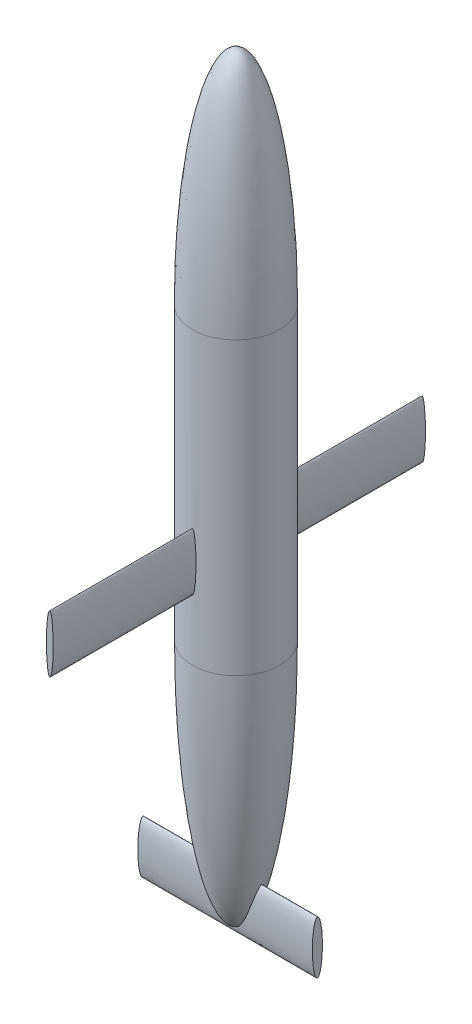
ISO-10303-21;
HEADER;
FILE_DESCRIPTION(('STEP AP214'),'2;1');
FILE_NAME('part.step','',(''),(''),'','','');
FILE_SCHEMA(('AUTOMOTIVE_DESIGN { 1 0 10303 214 1 1 1 1 }'));
ENDSEC;
DATA;
#1=APPLICATION_CONTEXT('core data for automotive mechanical design processes');
#2=APPLICATION_PROTOCOL_DEFINITION('international standard','automotive_design',2000,#1);
#3=PRODUCT_CONTEXT('',#1,'mechanical');
#4=PRODUCT('Part','Part','',(#3));
#5=PRODUCT_RELATED_PRODUCT_CATEGORY('part','',(#4));
#6=PRODUCT_DEFINITION_FORMATION('','',#4);
#7=PRODUCT_DEFINITION_CONTEXT('part definition',#1,'design');
#8=PRODUCT_DEFINITION('design','',#6,#7);
#9=PRODUCT_DEFINITION_SHAPE('','',#8);
#10=(LENGTH_UNIT() NAMED_UNIT(*) SI_UNIT(.MILLI.,.METRE.));
#11=(NAMED_UNIT(*) PLANE_ANGLE_UNIT() SI_UNIT($,.RADIAN.));
#12=(NAMED_UNIT(*) SI_UNIT($,.STERADIAN.) SOLID_ANGLE_UNIT());
#13=UNCERTAINTY_MEASURE_WITH_UNIT(LENGTH_MEASURE(1.E-05),#10,'distance_accuracy_value','');
#14=(GEOMETRIC_REPRESENTATION_CONTEXT(3) GLOBAL_UNCERTAINTY_ASSIGNED_CONTEXT((#13)) GLOBAL_UNIT_ASSIGNED_CONTEXT((#10,
#11,#12)) REPRESENTATION_CONTEXT('',''));
#15=CARTESIAN_POINT('',(0.,0.,0.));
#16=DIRECTION('',(0.,0.,1.));
#17=DIRECTION('',(1.,0.,0.));
#18=AXIS2_PLACEMENT_3D('',#15,#16,#17);
#19=CARTESIAN_POINT('',(0.,-1000.,0.));
#20=DIRECTION('',(0.,1.,0.));
#21=DIRECTION('',(0.,0.,1.));
#22=AXIS2_PLACEMENT_3D('',#19,#20,#21);
#23=CYLINDRICAL_SURFACE('',#22,149.407975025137);
#24=CARTESIAN_POINT('',(0.,-592.883691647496,-149.407975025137));
#25=CARTESIAN_POINT('',(0.0437177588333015,-592.883692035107,-149.407975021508));
#26=CARTESIAN_POINT('',(0.087435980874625,-592.885761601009,-149.407955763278));
#27=CARTESIAN_POINT('',(0.174496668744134,-592.893959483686,-149.407879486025));
#28=CARTESIAN_POINT('',(0.217838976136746,-592.900089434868,-149.407822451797));
#29=CARTESIAN_POINT('',(0.346895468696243,-592.924323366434,-149.407597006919));
#30=CARTESIAN_POINT('',(0.431552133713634,-592.948270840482,-149.407374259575));
#31=CARTESIAN_POINT('',(0.620275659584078,-593.01804783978,-149.406725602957));
#32=CARTESIAN_POINT('',(0.722676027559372,-593.068254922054,-149.406259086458));
#33=CARTESIAN_POINT('',(0.918365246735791,-593.183991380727,-149.40518478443));
#34=CARTESIAN_POINT('',(1.01163319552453,-593.249554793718,-149.404576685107));
#35=CARTESIAN_POINT('',(1.1824100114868,-593.385366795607,-149.403318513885));
#36=CARTESIAN_POINT('',(1.26058373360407,-593.454798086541,-149.4026759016));
#37=CARTESIAN_POINT('',(1.41079792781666,-593.600063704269,-149.401332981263));
#38=CARTESIAN_POINT('',(1.48283262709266,-593.675903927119,-149.400632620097));
#39=CARTESIAN_POINT('',(1.62179130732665,-593.832438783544,-149.399188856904));
#40=CARTESIAN_POINT('',(1.68870140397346,-593.913145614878,-149.39844534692));
#41=CARTESIAN_POINT('',(1.81797038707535,-594.078042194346,-149.396928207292));
#42=CARTESIAN_POINT('',(1.88033122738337,-594.162230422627,-149.396154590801));
#43=CARTESIAN_POINT('',(2.00959028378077,-594.345209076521,-149.394475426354));
#44=CARTESIAN_POINT('',(2.07591473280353,-594.444402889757,-149.393566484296));
#45=CARTESIAN_POINT('',(2.20434198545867,-594.645499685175,-149.391726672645));
#46=CARTESIAN_POINT('',(2.26644383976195,-594.747403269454,-149.390795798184));
#47=CARTESIAN_POINT('',(2.38713194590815,-594.953507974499,-149.388916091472));
#48=CARTESIAN_POINT('',(2.44571170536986,-595.05771288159,-149.387967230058));
#49=CARTESIAN_POINT('',(2.55972615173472,-595.267833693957,-149.386057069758));
#50=CARTESIAN_POINT('',(2.61516054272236,-595.373749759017,-149.385095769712));
#51=CARTESIAN_POINT('',(2.77745071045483,-595.693763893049,-149.382196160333));
#52=CARTESIAN_POINT('',(2.88019207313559,-595.909951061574,-149.380243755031));
#53=CARTESIAN_POINT('',(3.07753530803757,-596.347208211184,-149.376308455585));
#54=CARTESIAN_POINT('',(3.17209569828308,-596.568296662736,-149.37432546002));
#55=CARTESIAN_POINT('',(3.35405348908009,-597.013048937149,-149.370350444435));
#56=CARTESIAN_POINT('',(3.44146015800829,-597.236708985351,-149.368358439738));
#57=CARTESIAN_POINT('',(3.61041010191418,-597.686119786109,-149.364370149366));
#58=CARTESIAN_POINT('',(3.6919556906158,-597.91186967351,-149.362373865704));
#59=CARTESIAN_POINT('',(3.84125869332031,-598.339711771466,-149.358604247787));
#60=CARTESIAN_POINT('',(3.90953762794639,-598.541622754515,-149.356830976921));
#61=CARTESIAN_POINT('',(4.04268871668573,-598.94656644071,-149.353286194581));
#62=CARTESIAN_POINT('',(4.10756079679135,-599.149599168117,-149.351514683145));
#63=CARTESIAN_POINT('',(4.29769154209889,-599.760145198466,-149.346205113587));
#64=CARTESIAN_POINT('',(4.41844963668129,-600.169062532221,-149.342672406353));
#65=CARTESIAN_POINT('',(4.65042592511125,-600.989922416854,-149.335628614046));
#66=CARTESIAN_POINT('',(4.76163637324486,-601.401867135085,-149.332117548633));
#67=CARTESIAN_POINT('',(4.97606743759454,-602.227837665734,-149.325126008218));
#68=CARTESIAN_POINT('',(5.07928780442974,-602.641863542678,-149.321645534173));
#69=CARTESIAN_POINT('',(5.27863656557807,-603.470179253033,-149.314731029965));
#70=CARTESIAN_POINT('',(5.3747870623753,-603.884463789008,-149.311296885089));
#71=CARTESIAN_POINT('',(5.56129272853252,-604.714337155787,-149.304466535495));
#72=CARTESIAN_POINT('',(5.65164782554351,-605.129926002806,-149.30107033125));
#73=CARTESIAN_POINT('',(5.82725207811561,-605.962007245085,-149.294319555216));
#74=CARTESIAN_POINT('',(5.9125032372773,-606.378499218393,-149.290964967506));
#75=CARTESIAN_POINT('',(6.07851323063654,-607.212379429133,-149.284297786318));
#76=CARTESIAN_POINT('',(6.15927201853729,-607.629767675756,-149.280985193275));
#77=CARTESIAN_POINT('',(6.39505848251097,-608.880526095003,-149.271132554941));
#78=CARTESIAN_POINT('',(6.54412430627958,-609.71502347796,-149.264657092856));
#79=CARTESIAN_POINT('',(6.82918281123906,-611.386310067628,-149.251886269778));
#80=CARTESIAN_POINT('',(6.96517425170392,-612.223099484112,-149.245590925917));
#81=CARTESIAN_POINT('',(7.22612555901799,-613.898701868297,-149.233183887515));
#82=CARTESIAN_POINT('',(7.35108142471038,-614.737515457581,-149.227072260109));
#83=CARTESIAN_POINT('',(7.5914211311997,-616.416515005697,-149.215038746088));
#84=CARTESIAN_POINT('',(7.70680489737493,-617.256700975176,-149.209116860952));
#85=CARTESIAN_POINT('',(7.92910509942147,-618.937736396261,-149.197468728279));
#86=CARTESIAN_POINT('',(8.03602600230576,-619.778585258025,-149.191742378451));
#87=CARTESIAN_POINT('',(8.24237944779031,-621.461204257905,-149.180484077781));
#88=CARTESIAN_POINT('',(8.34181194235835,-622.302974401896,-149.174952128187));
#89=CARTESIAN_POINT('',(8.62999163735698,-624.829201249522,-149.158651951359));
#90=CARTESIAN_POINT('',(8.80865240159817,-626.514815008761,-149.148177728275));
#91=CARTESIAN_POINT('',(9.14353130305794,-629.888501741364,-149.128021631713));
#92=CARTESIAN_POINT('',(9.29974608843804,-631.57657504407,-149.118339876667));
#93=CARTESIAN_POINT('',(9.59276630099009,-634.954423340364,-149.099776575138));
#94=CARTESIAN_POINT('',(9.72957149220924,-636.644198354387,-149.090895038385));
#95=CARTESIAN_POINT('',(9.98604236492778,-640.025187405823,-149.073936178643));
#96=CARTESIAN_POINT('',(10.10570661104,-641.716401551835,-149.065858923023));
#97=CARTESIAN_POINT('',(10.3295789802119,-645.099853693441,-149.050512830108));
#98=CARTESIAN_POINT('',(10.433787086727,-646.792091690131,-149.043243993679));
#99=CARTESIAN_POINT('',(10.6280282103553,-650.177006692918,-149.029518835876));
#100=CARTESIAN_POINT('',(10.7180643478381,-651.86968351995,-149.023062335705));
#101=CARTESIAN_POINT('',(10.8849997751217,-655.255693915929,-149.010961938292));
#102=CARTESIAN_POINT('',(10.9618989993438,-656.949027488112,-149.005318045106));
#103=CARTESIAN_POINT('',(11.1033491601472,-660.336222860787,-148.994844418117));
#104=CARTESIAN_POINT('',(11.1679000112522,-662.030084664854,-148.99001468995));
#105=CARTESIAN_POINT('',(11.2852670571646,-665.418217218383,-148.981170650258));
#106=CARTESIAN_POINT('',(11.3380832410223,-667.112487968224,-148.977156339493));
#107=CARTESIAN_POINT('',(11.4324515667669,-670.501263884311,-148.969944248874));
#108=CARTESIAN_POINT('',(11.4740042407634,-672.195769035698,-148.966746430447));
#109=CARTESIAN_POINT('',(11.546202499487,-675.584992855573,-148.961167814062));
#110=CARTESIAN_POINT('',(11.5768482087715,-677.279711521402,-148.958787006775));
#111=CARTESIAN_POINT('',(11.6274865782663,-680.669329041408,-148.954842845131));
#112=CARTESIAN_POINT('',(11.6474791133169,-682.364227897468,-148.953279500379));
#113=CARTESIAN_POINT('',(11.6769665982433,-685.754120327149,-148.950970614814));
#114=CARTESIAN_POINT('',(11.6864615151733,-687.44911390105,-148.950225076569));
#115=CARTESIAN_POINT('',(11.6993358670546,-692.534092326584,-148.949215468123));
#116=CARTESIAN_POINT('',(11.6871057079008,-695.924129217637,-148.95017834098));
#117=CARTESIAN_POINT('',(11.620684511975,-702.703792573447,-148.955375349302));
#118=CARTESIAN_POINT('',(11.5664935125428,-706.093419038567,-148.959609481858));
#119=CARTESIAN_POINT('',(11.4523692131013,-711.177145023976,-148.968411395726));
#120=CARTESIAN_POINT('',(11.4088539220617,-712.871626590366,-148.971753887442));
#121=CARTESIAN_POINT('',(11.3104835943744,-716.260257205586,-148.979255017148));
#122=CARTESIAN_POINT('',(11.2556285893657,-717.954406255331,-148.983413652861));
#123=CARTESIAN_POINT('',(11.1340880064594,-721.342281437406,-148.992546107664));
#124=CARTESIAN_POINT('',(11.0674024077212,-723.036007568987,-148.997519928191));
#125=CARTESIAN_POINT('',(10.9215569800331,-726.422921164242,-149.008281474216));
#126=CARTESIAN_POINT('',(10.8423971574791,-728.116108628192,-149.014069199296));
#127=CARTESIAN_POINT('',(10.670773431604,-731.501936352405,-149.026457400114));
#128=CARTESIAN_POINT('',(10.5783085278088,-733.194576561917,-149.033057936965));
#129=CARTESIAN_POINT('',(10.3790223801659,-736.579015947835,-149.04706935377));
#130=CARTESIAN_POINT('',(10.2722010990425,-738.270815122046,-149.054480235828));
#131=CARTESIAN_POINT('',(10.0428375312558,-741.653392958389,-149.070109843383));
#132=CARTESIAN_POINT('',(9.92029483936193,-743.344171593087,-149.078328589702));
#133=CARTESIAN_POINT('',(9.65770626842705,-746.724357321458,-149.095570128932));
#134=CARTESIAN_POINT('',(9.5176605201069,-748.41376442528,-149.104592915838));
#135=CARTESIAN_POINT('',(9.2176471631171,-751.791402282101,-149.123441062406));
#136=CARTESIAN_POINT('',(9.05767279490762,-753.479632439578,-149.133266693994));
#137=CARTESIAN_POINT('',(8.80030947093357,-756.010231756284,-149.148599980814));
#138=CARTESIAN_POINT('',(8.71161936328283,-756.853491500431,-149.153810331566));
#139=CARTESIAN_POINT('',(8.52788837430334,-758.539316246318,-149.164428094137));
#140=CARTESIAN_POINT('',(8.43284752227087,-759.381881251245,-149.169835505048));
#141=CARTESIAN_POINT('',(8.23575402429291,-761.066340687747,-149.180846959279));
#142=CARTESIAN_POINT('',(8.13370015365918,-761.908234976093,-149.186451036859));
#143=CARTESIAN_POINT('',(7.92179885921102,-763.591037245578,-149.197853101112));
#144=CARTESIAN_POINT('',(7.81195149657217,-764.431945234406,-149.203651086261));
#145=CARTESIAN_POINT('',(7.58347245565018,-766.112515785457,-149.215438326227));
#146=CARTESIAN_POINT('',(7.46484132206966,-766.952178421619,-149.22142756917));
#147=CARTESIAN_POINT('',(7.21752179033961,-768.63001340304,-149.233594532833));
#148=CARTESIAN_POINT('',(7.08883357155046,-769.468185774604,-149.239772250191));
#149=CARTESIAN_POINT('',(6.8645148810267,-770.863888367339,-149.250224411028));
#150=CARTESIAN_POINT('',(6.77214348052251,-771.421943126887,-149.254447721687));
#151=CARTESIAN_POINT('',(6.58152688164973,-772.53705847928,-149.262974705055));
#152=CARTESIAN_POINT('',(6.48328160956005,-773.094119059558,-149.26727837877));
#153=CARTESIAN_POINT('',(6.28011749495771,-774.207062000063,-149.275964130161));
#154=CARTESIAN_POINT('',(6.17519822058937,-774.762944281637,-149.280346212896));
#155=CARTESIAN_POINT('',(5.95773733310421,-775.8729041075,-149.289183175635));
#156=CARTESIAN_POINT('',(5.84519994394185,-776.426982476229,-149.293638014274));
#157=CARTESIAN_POINT('',(5.61113230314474,-777.533214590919,-149.302618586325));
#158=CARTESIAN_POINT('',(5.48960248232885,-778.085368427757,-149.307144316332));
#159=CARTESIAN_POINT('',(5.23578593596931,-779.18715471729,-149.31626074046));
#160=CARTESIAN_POINT('',(5.10350043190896,-779.736787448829,-149.320851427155));
#161=CARTESIAN_POINT('',(4.8895352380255,-780.580645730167,-149.327964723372));
#162=CARTESIAN_POINT('',(4.81256533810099,-780.876067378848,-149.330467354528));
#163=CARTESIAN_POINT('',(4.65419937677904,-781.465730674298,-149.33548713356));
#164=CARTESIAN_POINT('',(4.57280325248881,-781.759972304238,-149.338004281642));
#165=CARTESIAN_POINT('',(4.40490344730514,-782.347069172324,-149.343051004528));
#166=CARTESIAN_POINT('',(4.31839864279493,-782.639924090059,-149.345580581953));
#167=CARTESIAN_POINT('',(4.13944205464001,-783.223804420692,-149.350647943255));
#168=CARTESIAN_POINT('',(4.04699055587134,-783.514829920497,-149.353185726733));
#169=CARTESIAN_POINT('',(3.85537423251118,-784.093417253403,-149.358254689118));
#170=CARTESIAN_POINT('',(3.75623686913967,-784.380988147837,-149.360785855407));
#171=CARTESIAN_POINT('',(3.54941825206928,-784.953044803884,-149.365844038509));
#172=CARTESIAN_POINT('',(3.44173779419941,-785.237530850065,-149.368371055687));
#173=CARTESIAN_POINT('',(3.27208883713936,-785.66122695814,-149.372151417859));
#174=CARTESIAN_POINT('',(3.21414161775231,-785.802049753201,-149.373410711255));
#175=CARTESIAN_POINT('',(3.0951785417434,-786.082390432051,-149.375923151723));
#176=CARTESIAN_POINT('',(3.03416282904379,-786.221908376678,-149.377176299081));
#177=CARTESIAN_POINT('',(2.90863705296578,-786.499298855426,-149.379673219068));
#178=CARTESIAN_POINT('',(2.84412845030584,-786.637172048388,-149.380916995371));
#179=CARTESIAN_POINT('',(2.71102890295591,-786.910926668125,-149.383391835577));
#180=CARTESIAN_POINT('',(2.64243834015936,-787.046808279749,-149.384622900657));
#181=CARTESIAN_POINT('',(2.50006741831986,-787.316749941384,-149.387073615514));
#182=CARTESIAN_POINT('',(2.42626173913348,-787.450796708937,-149.388293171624));
#183=CARTESIAN_POINT('',(2.27278308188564,-787.715580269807,-149.390707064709));
#184=CARTESIAN_POINT('',(2.19310799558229,-787.846315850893,-149.391901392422));
#185=CARTESIAN_POINT('',(2.02693421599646,-788.102715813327,-149.394248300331));
#186=CARTESIAN_POINT('',(1.94046228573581,-788.228397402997,-149.395401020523));
#187=CARTESIAN_POINT('',(1.75876865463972,-788.473217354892,-149.397650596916));
#188=CARTESIAN_POINT('',(1.66355499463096,-788.592361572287,-149.398747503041));
#189=CARTESIAN_POINT('',(1.48323986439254,-788.796879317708,-149.400633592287));
#190=CARTESIAN_POINT('',(1.40022855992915,-788.884082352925,-149.401438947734));
#191=CARTESIAN_POINT('',(1.22562511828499,-789.050039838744,-149.402973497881));
#192=CARTESIAN_POINT('',(1.13401733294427,-789.128778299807,-149.403702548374));
#193=CARTESIAN_POINT('',(0.988616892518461,-789.237708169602,-149.404712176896));
#194=CARTESIAN_POINT('',(0.938422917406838,-789.272709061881,-149.405036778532));
#195=CARTESIAN_POINT('',(0.835386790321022,-789.338632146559,-149.405648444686));
#196=CARTESIAN_POINT('',(0.782544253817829,-789.369553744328,-149.40593550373));
#197=CARTESIAN_POINT('',(0.674408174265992,-789.426315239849,-149.406462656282));
#198=CARTESIAN_POINT('',(0.619124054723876,-789.452172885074,-149.406702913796));
#199=CARTESIAN_POINT('',(0.506174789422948,-789.497937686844,-149.407128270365));
#200=CARTESIAN_POINT('',(0.448511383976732,-789.517849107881,-149.40731340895));
#201=CARTESIAN_POINT('',(0.312261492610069,-789.556060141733,-149.407668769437));
#202=CARTESIAN_POINT('',(0.232918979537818,-789.57177409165,-149.40781497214));
#203=CARTESIAN_POINT('',(0.0727409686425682,-789.589376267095,-149.407978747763));
#204=CARTESIAN_POINT('',(-0.008093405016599,-789.591274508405,-149.407996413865));
#205=CARTESIAN_POINT('',(-0.168786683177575,-789.581050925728,-149.407901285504));
#206=CARTESIAN_POINT('',(-0.24864628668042,-789.568939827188,-149.407788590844));
#207=CARTESIAN_POINT('',(-0.405391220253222,-789.532074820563,-149.407445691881));
#208=CARTESIAN_POINT('',(-0.482273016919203,-789.507306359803,-149.407215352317));
#209=CARTESIAN_POINT('',(-0.665695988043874,-789.433733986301,-149.406531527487));
#210=CARTESIAN_POINT('',(-0.769882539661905,-789.379124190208,-149.406024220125));
#211=CARTESIAN_POINT('',(-0.968608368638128,-789.254587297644,-149.404868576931));
#212=CARTESIAN_POINT('',(-1.06312142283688,-789.184620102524,-149.404219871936));
#213=CARTESIAN_POINT('',(-1.23858066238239,-789.038347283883,-149.402865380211));
#214=CARTESIAN_POINT('',(-1.319980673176,-788.962575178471,-149.402164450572));
#215=CARTESIAN_POINT('',(-1.4761385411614,-788.804411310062,-149.40070320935));
#216=CARTESIAN_POINT('',(-1.55088979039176,-788.722013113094,-149.399942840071));
#217=CARTESIAN_POINT('',(-1.69493601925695,-788.552225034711,-149.398378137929));
#218=CARTESIAN_POINT('',(-1.76421499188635,-788.464821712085,-149.39757368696));
#219=CARTESIAN_POINT('',(-1.89793980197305,-788.286491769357,-149.395934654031));
#220=CARTESIAN_POINT('',(-1.96238814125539,-788.195567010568,-149.395100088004));
#221=CARTESIAN_POINT('',(-2.09205685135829,-788.003818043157,-149.393342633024));
#222=CARTESIAN_POINT('',(-2.15694911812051,-787.902773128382,-149.392417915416));
#223=CARTESIAN_POINT('',(-2.28273244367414,-787.698211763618,-149.390548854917));
#224=CARTESIAN_POINT('',(-2.34362276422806,-787.594694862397,-149.389604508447));
#225=CARTESIAN_POINT('',(-2.46206017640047,-787.385535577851,-149.387699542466));
#226=CARTESIAN_POINT('',(-2.51960127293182,-787.279889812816,-149.386738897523));
#227=CARTESIAN_POINT('',(-2.63168125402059,-787.067013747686,-149.384806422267));
#228=CARTESIAN_POINT('',(-2.68621989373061,-786.959783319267,-149.38383459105));
#229=CARTESIAN_POINT('',(-2.84613061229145,-786.635688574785,-149.380902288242));
#230=CARTESIAN_POINT('',(-2.94754787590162,-786.416870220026,-149.378929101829));
#231=CARTESIAN_POINT('',(-3.14210420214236,-785.975523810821,-149.374963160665));
#232=CARTESIAN_POINT('',(-3.23523987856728,-785.752994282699,-149.372970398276));
#233=CARTESIAN_POINT('',(-3.41538005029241,-785.303613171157,-149.368960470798));
#234=CARTESIAN_POINT('',(-3.50233543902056,-785.076741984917,-149.366943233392));
#235=CARTESIAN_POINT('',(-3.67037277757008,-784.621303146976,-149.362908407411));
#236=CARTESIAN_POINT('',(-3.75146487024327,-784.392739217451,-149.360890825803));
#237=CARTESIAN_POINT('',(-3.90873637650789,-783.934159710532,-149.356857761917));
#238=CARTESIAN_POINT('',(-3.98492008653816,-783.704145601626,-149.354842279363));
#239=CARTESIAN_POINT('',(-4.13309839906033,-783.242834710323,-149.350815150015));
#240=CARTESIAN_POINT('',(-4.20509395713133,-783.01153823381,-149.348803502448));
#241=CARTESIAN_POINT('',(-4.36702218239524,-782.476549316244,-149.344168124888));
#242=CARTESIAN_POINT('',(-4.45566271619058,-782.172466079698,-149.341546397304));
#243=CARTESIAN_POINT('',(-4.62763684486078,-781.562797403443,-149.336316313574));
#244=CARTESIAN_POINT('',(-4.71097024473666,-781.257211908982,-149.333707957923));
#245=CARTESIAN_POINT('',(-4.87309900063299,-780.644574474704,-149.328505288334));
#246=CARTESIAN_POINT('',(-4.95189058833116,-780.337521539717,-149.32591098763));
#247=CARTESIAN_POINT('',(-5.10542026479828,-779.722401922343,-149.320740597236));
#248=CARTESIAN_POINT('',(-5.18015828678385,-779.414335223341,-149.318164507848));
#249=CARTESIAN_POINT('',(-5.39903213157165,-778.48869629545,-149.310464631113));
#250=CARTESIAN_POINT('',(-5.5377851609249,-777.869848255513,-149.305370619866));
#251=CARTESIAN_POINT('',(-5.80298935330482,-776.632874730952,-149.295297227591));
#252=CARTESIAN_POINT('',(-5.92950012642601,-776.014761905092,-149.290317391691));
#253=CARTESIAN_POINT('',(-6.17286221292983,-774.776868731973,-149.280452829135));
#254=CARTESIAN_POINT('',(-6.28971691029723,-774.157089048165,-149.275568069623));
#255=CARTESIAN_POINT('',(-6.51520580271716,-772.916096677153,-149.265896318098));
#256=CARTESIAN_POINT('',(-6.62384069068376,-772.294884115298,-149.261109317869));
#257=CARTESIAN_POINT('',(-6.88635481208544,-770.741350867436,-149.249274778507));
#258=CARTESIAN_POINT('',(-7.03579953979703,-769.80828030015,-149.242289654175));
#259=CARTESIAN_POINT('',(-7.32140290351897,-767.940044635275,-149.228551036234));
#260=CARTESIAN_POINT('',(-7.45756045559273,-767.00487937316,-149.221797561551));
#261=CARTESIAN_POINT('',(-7.71866939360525,-765.131816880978,-149.208519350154));
#262=CARTESIAN_POINT('',(-7.84360678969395,-764.193917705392,-149.201994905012));
#263=CARTESIAN_POINT('',(-8.08355582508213,-762.316876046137,-149.189187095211));
#264=CARTESIAN_POINT('',(-8.19856769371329,-761.377733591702,-149.182903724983));
#265=CARTESIAN_POINT('',(-8.41976628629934,-759.49878680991,-149.170582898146));
#266=CARTESIAN_POINT('',(-8.52595647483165,-758.558982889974,-149.164545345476));
#267=CARTESIAN_POINT('',(-8.73045979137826,-756.67851567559,-149.152715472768));
#268=CARTESIAN_POINT('',(-8.82877287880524,-755.737852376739,-149.146923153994));
#269=CARTESIAN_POINT('',(-9.11303120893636,-752.914733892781,-149.129916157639));
#270=CARTESIAN_POINT('',(-9.28829025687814,-751.03119548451,-149.11907173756));
#271=CARTESIAN_POINT('',(-9.6146585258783,-747.262738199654,-149.098383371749));
#272=CARTESIAN_POINT('',(-9.76577650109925,-745.377820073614,-149.088539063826));
#273=CARTESIAN_POINT('',(-10.0469868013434,-741.606404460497,-149.069852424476));
#274=CARTESIAN_POINT('',(-10.1770789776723,-739.719906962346,-149.061010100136));
#275=CARTESIAN_POINT('',(-10.4184548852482,-735.946097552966,-149.044333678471));
#276=CARTESIAN_POINT('',(-10.5297424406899,-734.058785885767,-149.036499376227));
#277=CARTESIAN_POINT('',(-10.7352108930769,-730.283226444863,-149.02184015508));
#278=CARTESIAN_POINT('',(-10.8293917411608,-728.3949786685,-149.015015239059));
#279=CARTESIAN_POINT('',(-11.0019156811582,-724.617639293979,-149.002376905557));
#280=CARTESIAN_POINT('',(-11.0802577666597,-722.72854764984,-148.996563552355));
#281=CARTESIAN_POINT('',(-11.2220551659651,-718.949807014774,-148.985950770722));
#282=CARTESIAN_POINT('',(-11.2855104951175,-717.060158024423,-148.981151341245));
#283=CARTESIAN_POINT('',(-11.3982502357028,-713.280611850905,-148.972568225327));
#284=CARTESIAN_POINT('',(-11.4475359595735,-711.390714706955,-148.968784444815));
#285=CARTESIAN_POINT('',(-11.5324726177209,-707.610612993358,-148.962233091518));
#286=CARTESIAN_POINT('',(-11.5681235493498,-705.720408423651,-148.959465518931));
#287=CARTESIAN_POINT('',(-11.6261560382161,-701.939830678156,-148.954947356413));
#288=CARTESIAN_POINT('',(-11.6485378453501,-700.049457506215,-148.953196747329));
#289=CARTESIAN_POINT('',(-11.680256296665,-696.268596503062,-148.950712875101));
#290=CARTESIAN_POINT('',(-11.6895929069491,-694.378108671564,-148.949979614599));
#291=CARTESIAN_POINT('',(-11.6953124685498,-690.597110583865,-148.949530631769));
#292=CARTESIAN_POINT('',(-11.6916954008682,-688.706600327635,-148.949814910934));
#293=CARTESIAN_POINT('',(-11.6714721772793,-684.925649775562,-148.951400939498));
#294=CARTESIAN_POINT('',(-11.6548660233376,-683.035209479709,-148.952702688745));
#295=CARTESIAN_POINT('',(-11.608500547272,-679.25449400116,-148.956323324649));
#296=CARTESIAN_POINT('',(-11.5787412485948,-677.364218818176,-148.958642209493));
#297=CARTESIAN_POINT('',(-11.5057685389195,-673.583934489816,-148.964296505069));
#298=CARTESIAN_POINT('',(-11.4625551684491,-671.693925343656,-148.967631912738));
#299=CARTESIAN_POINT('',(-11.3622194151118,-667.914229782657,-148.975318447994));
#300=CARTESIAN_POINT('',(-11.3050966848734,-666.024543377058,-148.979669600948));
#301=CARTESIAN_POINT('',(-11.1763114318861,-662.24566548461,-148.989386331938));
#302=CARTESIAN_POINT('',(-11.1046488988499,-660.356473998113,-148.994751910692));
#303=CARTESIAN_POINT('',(-10.9459344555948,-656.578667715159,-149.006496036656));
#304=CARTESIAN_POINT('',(-10.8588819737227,-654.690052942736,-149.012874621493));
#305=CARTESIAN_POINT('',(-10.6682706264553,-650.913660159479,-149.026642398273));
#306=CARTESIAN_POINT('',(-10.5647117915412,-649.025882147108,-149.03403158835));
#307=CARTESIAN_POINT('',(-10.3395921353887,-645.251042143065,-149.049819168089));
#308=CARTESIAN_POINT('',(-10.2180279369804,-643.363980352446,-149.058217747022));
#309=CARTESIAN_POINT('',(-9.95494363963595,-639.591231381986,-149.076019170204));
#310=CARTESIAN_POINT('',(-9.8134233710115,-637.705544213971,-149.085422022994));
#311=CARTESIAN_POINT('',(-9.50779061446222,-633.936081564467,-149.105226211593));
#312=CARTESIAN_POINT('',(-9.34367927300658,-632.052305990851,-149.115627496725));
#313=CARTESIAN_POINT('',(-9.07775068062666,-629.228530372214,-149.131972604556));
#314=CARTESIAN_POINT('',(-8.98581491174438,-628.287592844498,-149.137544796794));
#315=CARTESIAN_POINT('',(-8.79472516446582,-626.406454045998,-149.148935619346));
#316=CARTESIAN_POINT('',(-8.69557122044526,-625.466252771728,-149.154754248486));
#317=CARTESIAN_POINT('',(-8.4893052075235,-623.586743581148,-149.166636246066));
#318=CARTESIAN_POINT('',(-8.38219330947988,-622.647435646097,-149.172699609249));
#319=CARTESIAN_POINT('',(-8.15908253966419,-620.769871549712,-149.185069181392));
#320=CARTESIAN_POINT('',(-8.04308364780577,-619.831615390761,-149.191375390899));
#321=CARTESIAN_POINT('',(-7.80103182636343,-617.956425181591,-149.20422780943));
#322=CARTESIAN_POINT('',(-7.67497917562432,-617.019491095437,-149.210774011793));
#323=CARTESIAN_POINT('',(-7.41131227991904,-615.14725396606,-149.224102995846));
#324=CARTESIAN_POINT('',(-7.27369818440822,-614.211950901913,-149.230885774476));
#325=CARTESIAN_POINT('',(-7.03867698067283,-612.691512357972,-149.242112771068));
#326=CARTESIAN_POINT('',(-6.9453911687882,-612.105738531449,-149.246486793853));
#327=CARTESIAN_POINT('',(-6.75281207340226,-610.935180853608,-149.255324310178));
#328=CARTESIAN_POINT('',(-6.65351883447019,-610.350396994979,-149.259787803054));
#329=CARTESIAN_POINT('',(-6.44812424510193,-609.182036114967,-149.268802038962));
#330=CARTESIAN_POINT('',(-6.34202303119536,-608.598459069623,-149.273352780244));
#331=CARTESIAN_POINT('',(-6.12199168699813,-607.432783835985,-149.282538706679));
#332=CARTESIAN_POINT('',(-6.00806166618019,-606.850685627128,-149.287173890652));
#333=CARTESIAN_POINT('',(-5.80910732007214,-605.875091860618,-149.295022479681));
#334=CARTESIAN_POINT('',(-5.72655723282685,-605.481091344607,-149.298214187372));
#335=CARTESIAN_POINT('',(-5.55669006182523,-604.694120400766,-149.304632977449));
#336=CARTESIAN_POINT('',(-5.46937302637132,-604.30114996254,-149.307860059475));
#337=CARTESIAN_POINT('',(-5.2893052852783,-603.516448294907,-149.314347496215));
#338=CARTESIAN_POINT('',(-5.19655451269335,-603.12471708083,-149.317607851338));
#339=CARTESIAN_POINT('',(-5.00477749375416,-602.342794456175,-149.324158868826));
#340=CARTESIAN_POINT('',(-4.90575137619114,-601.952603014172,-149.327449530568));
#341=CARTESIAN_POINT('',(-4.73296321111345,-601.297889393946,-149.333006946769));
#342=CARTESIAN_POINT('',(-4.66117609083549,-601.032845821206,-149.335266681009));
#343=CARTESIAN_POINT('',(-4.51371164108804,-600.503844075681,-149.339796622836));
#344=CARTESIAN_POINT('',(-4.43803437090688,-600.239885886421,-149.342066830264));
#345=CARTESIAN_POINT('',(-4.28223966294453,-599.713306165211,-149.346615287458));
#346=CARTESIAN_POINT('',(-4.20212262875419,-599.450684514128,-149.348893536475));
#347=CARTESIAN_POINT('',(-4.03673923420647,-598.927067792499,-149.353455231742));
#348=CARTESIAN_POINT('',(-3.95147303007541,-598.666072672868,-149.355738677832));
#349=CARTESIAN_POINT('',(-3.80247496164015,-598.227422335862,-149.359592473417));
#350=CARTESIAN_POINT('',(-3.74034506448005,-598.049222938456,-149.361162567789));
#351=CARTESIAN_POINT('',(-3.61283209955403,-597.693992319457,-149.36430134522));
#352=CARTESIAN_POINT('',(-3.54744909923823,-597.516961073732,-149.365870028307));
#353=CARTESIAN_POINT('',(-3.4129485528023,-597.164286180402,-149.36900384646));
#354=CARTESIAN_POINT('',(-3.34383040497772,-596.988642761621,-149.370568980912));
#355=CARTESIAN_POINT('',(-3.20127815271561,-596.639116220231,-149.373692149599));
#356=CARTESIAN_POINT('',(-3.12784422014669,-596.465233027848,-149.375250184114));
#357=CARTESIAN_POINT('',(-2.98376867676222,-596.137606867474,-149.378193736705));
#358=CARTESIAN_POINT('',(-2.91362683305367,-595.983644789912,-149.379580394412));
#359=CARTESIAN_POINT('',(-2.76854520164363,-595.67799855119,-149.382339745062));
#360=CARTESIAN_POINT('',(-2.69360575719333,-595.526314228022,-149.383712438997));
#361=CARTESIAN_POINT('',(-2.53793754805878,-595.225803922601,-149.386438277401));
#362=CARTESIAN_POINT('',(-2.45720499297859,-595.07697989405,-149.387791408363));
#363=CARTESIAN_POINT('',(-2.28875974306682,-594.783344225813,-149.390467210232));
#364=CARTESIAN_POINT('',(-2.20104916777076,-594.638531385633,-149.391789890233));
#365=CARTESIAN_POINT('',(-2.05134585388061,-594.407664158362,-149.393903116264));
#366=CARTESIAN_POINT('',(-1.99200513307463,-594.319892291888,-149.394707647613));
#367=CARTESIAN_POINT('',(-1.86934762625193,-594.147181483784,-149.396292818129));
#368=CARTESIAN_POINT('',(-1.80603171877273,-594.062241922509,-149.397073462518));
#369=CARTESIAN_POINT('',(-1.6748369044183,-593.896155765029,-149.398601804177));
#370=CARTESIAN_POINT('',(-1.60696552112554,-593.815003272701,-149.39934955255));
#371=CARTESIAN_POINT('',(-1.46578217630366,-593.657617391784,-149.400801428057));
#372=CARTESIAN_POINT('',(-1.3924735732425,-593.581381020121,-149.401505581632));
#373=CARTESIAN_POINT('',(-1.23510459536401,-593.431467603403,-149.402891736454));
#374=CARTESIAN_POINT('',(-1.15067141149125,-593.358175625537,-149.403570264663));
#375=CARTESIAN_POINT('',(-0.973475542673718,-593.22224797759,-149.404829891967));
#376=CARTESIAN_POINT('',(-0.880715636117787,-593.159608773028,-149.405411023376));
#377=CARTESIAN_POINT('',(-0.702503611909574,-593.058981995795,-149.406345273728));
#378=CARTESIAN_POINT('',(-0.618429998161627,-593.018622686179,-149.40672028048));
#379=CARTESIAN_POINT('',(-0.488344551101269,-592.968818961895,-149.407183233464));
#380=CARTESIAN_POINT('',(-0.444362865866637,-592.95401569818,-149.407320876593));
#381=CARTESIAN_POINT('',(-0.355265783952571,-592.928380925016,-149.407559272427));
#382=CARTESIAN_POINT('',(-0.310151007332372,-592.917547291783,-149.407660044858));
#383=CARTESIAN_POINT('',(-0.221041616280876,-592.900581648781,-149.407817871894));
#384=CARTESIAN_POINT('',(-0.177081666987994,-592.894268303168,-149.407876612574));
#385=CARTESIAN_POINT('',(-0.0887480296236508,-592.885822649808,-149.40795519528));
#386=CARTESIAN_POINT('',(-0.0443742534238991,-592.883691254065,-149.40797502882));
#387=CARTESIAN_POINT('',(0.,-592.883691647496,-149.407975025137));
#388=B_SPLINE_CURVE_WITH_KNOTS('',3,(#24,#25,#26,#27,#28,#29,#30,#31,#32,#33,#34,#35,#36,#37,
#38,#39,#40,#41,#42,#43,#44,#45,#46,#47,#48,#49,#50,#51,#52,#53,#54,#55,#56,#57,#58,#59,#60,#61,
#62,#63,#64,#65,#66,#67,#68,#69,#70,#71,#72,#73,#74,#75,#76,#77,#78,#79,#80,#81,#82,#83,#84,#85,
#86,#87,#88,#89,#90,#91,#92,#93,#94,#95,#96,#97,#98,#99,#100,#101,#102,#103,#104,#105,#106,#107,
#108,#109,#110,#111,#112,#113,#114,#115,#116,#117,#118,#119,#120,#121,#122,#123,#124,#125,#126,
#127,#128,#129,#130,#131,#132,#133,#134,#135,#136,#137,#138,#139,#140,#141,#142,#143,#144,#145,
#146,#147,#148,#149,#150,#151,#152,#153,#154,#155,#156,#157,#158,#159,#160,#161,#162,#163,#164,
#165,#166,#167,#168,#169,#170,#171,#172,#173,#174,#175,#176,#177,#178,#179,#180,#181,#182,#183,
#184,#185,#186,#187,#188,#189,#190,#191,#192,#193,#194,#195,#196,#197,#198,#199,#200,#201,#202,
#203,#204,#205,#206,#207,#208,#209,#210,#211,#212,#213,#214,#215,#216,#217,#218,#219,#220,#221,
#222,#223,#224,#225,#226,#227,#228,#229,#230,#231,#232,#233,#234,#235,#236,#237,#238,#239,#240,
#241,#242,#243,#244,#245,#246,#247,#248,#249,#250,#251,#252,#253,#254,#255,#256,#257,#258,#259,
#260,#261,#262,#263,#264,#265,#266,#267,#268,#269,#270,#271,#272,#273,#274,#275,#276,#277,#278,
#279,#280,#281,#282,#283,#284,#285,#286,#287,#288,#289,#290,#291,#292,#293,#294,#295,#296,#297,
#298,#299,#300,#301,#302,#303,#304,#305,#306,#307,#308,#309,#310,#311,#312,#313,#314,#315,#316,
#317,#318,#319,#320,#321,#322,#323,#324,#325,#326,#327,#328,#329,#330,#331,#332,#333,#334,#335,
#336,#337,#338,#339,#340,#341,#342,#343,#344,#345,#346,#347,#348,#349,#350,#351,#352,#353,#354,
#355,#356,#357,#358,#359,#360,#361,#362,#363,#364,#365,#366,#367,#368,#369,#370,#371,#372,#373,
#374,#375,#376,#377,#378,#379,#380,#381,#382,#383,#384,#385,#386,#387),.UNSPECIFIED.,.T.,.F.,(4,
2,2,2,2,2,2,2,2,2,2,2,2,2,2,2,2,2,2,2,2,2,2,2,2,2,2,2,2,2,2,2,2,2,2,2,2,2,2,2,2,2,2,2,2,2,2,2,2,
2,2,2,2,2,2,2,2,2,2,2,2,2,2,2,2,2,2,2,2,2,2,2,2,2,2,2,2,2,2,2,2,2,2,2,2,2,2,2,2,2,2,2,2,2,2,2,2,
2,2,2,2,2,2,2,2,2,2,2,2,2,2,2,2,2,2,2,2,2,2,2,2,2,2,2,2,2,2,2,2,2,2,2,2,2,2,2,2,2,2,2,2,2,2,2,2,
2,2,2,2,2,2,2,2,2,2,2,2,2,2,2,2,2,2,2,2,2,2,2,2,2,2,2,2,2,2,2,2,2,2,2,2,4),(0.,
0.131102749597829,0.262258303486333,0.524826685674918,0.865069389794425,1.20607348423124,
1.51928646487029,1.83279079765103,2.1471164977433,2.46130639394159,2.81915858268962,
3.17709096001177,3.53566408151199,3.89427088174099,4.61209524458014,5.33336872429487,
6.05369241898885,6.77373017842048,7.41314831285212,8.05258033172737,9.33158332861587,
10.6116143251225,11.8916852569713,13.167567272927,14.4434652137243,15.7188589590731,
16.9942658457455,19.5373168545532,22.0806089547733,24.6248194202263,27.1690497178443,
29.7119279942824,32.2548225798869,37.3398838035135,42.4257035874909,47.5115851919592,
52.597892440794,57.6842051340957,62.769396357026,67.8546129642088,72.9398647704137,
78.0251213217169,83.1101375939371,88.195095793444,93.280113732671,98.3651476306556,
108.535052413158,118.704948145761,123.790047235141,128.875132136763,133.960225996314,
139.045317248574,144.130791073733,149.216278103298,154.301896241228,159.387476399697,
164.474786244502,167.0185476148,169.562297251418,172.106492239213,174.650667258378,
177.194684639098,179.738656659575,181.435621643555,183.132607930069,184.829704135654,
186.525866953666,188.221948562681,189.917837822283,190.833693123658,191.74956144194,
192.665631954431,193.581658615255,194.494128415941,195.406513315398,195.863337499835,
196.320140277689,196.776753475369,197.233324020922,197.692287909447,198.151417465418,
198.608821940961,199.065809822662,199.426604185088,199.788068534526,199.971493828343,
200.154945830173,200.337742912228,200.520408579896,200.761919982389,201.003256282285,
201.244407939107,201.485837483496,201.836715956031,202.188521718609,202.521655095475,
202.855115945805,203.189518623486,203.523746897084,203.883908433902,204.244136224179,
204.604990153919,204.965873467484,205.689180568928,206.412782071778,207.141606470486,
207.869138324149,208.596024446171,209.322744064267,210.272934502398,211.223159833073,
212.174162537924,213.125180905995,215.027722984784,216.920478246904,218.812567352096,
220.704496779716,223.539336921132,226.374408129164,229.212966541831,232.051459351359,
234.888832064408,237.726219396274,243.401131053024,249.073980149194,254.746869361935,
260.418603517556,266.090353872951,271.762464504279,277.434569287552,283.106148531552,
288.777728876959,294.449202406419,300.120690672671,305.792187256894,311.463682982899,
317.135168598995,322.806637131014,328.478247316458,334.149861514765,339.821686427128,
345.493500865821,351.166380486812,356.839308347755,362.511948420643,365.348229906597,
368.184497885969,371.020704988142,373.856918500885,376.693053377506,379.529151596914,
381.308640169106,383.088115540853,384.867555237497,386.646970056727,387.854649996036,
389.062317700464,390.270000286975,391.477658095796,392.301441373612,393.125212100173,
393.948908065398,394.77257905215,395.338731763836,395.904872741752,396.471105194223,
397.037315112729,397.544825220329,398.052299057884,398.560108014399,399.067763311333,
399.385531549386,399.7032298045,400.020415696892,400.337407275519,400.672226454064,
401.006934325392,401.285577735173,401.424641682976,401.563631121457,401.696673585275,
401.829745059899),.UNSPECIFIED.);
#389=CARTESIAN_POINT('',(0.,-592.883691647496,-149.407975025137));
#390=VERTEX_POINT('',#389);
#391=EDGE_CURVE('E55',#390,#390,#388,.T.);
#392=ORIENTED_EDGE('',*,*,#391,.F.);
#393=EDGE_LOOP('',(#392));
#394=FACE_BOUND('',#393,.T.);
#395=CARTESIAN_POINT('',(0.,0.,0.));
#396=DIRECTION('',(0.,1.,0.));
#397=DIRECTION('',(0.,0.,1.));
#398=AXIS2_PLACEMENT_3D('',#395,#396,#397);
#399=CIRCLE('',#398,149.407975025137);
#400=CARTESIAN_POINT('',(0.,0.,149.407975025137));
#401=VERTEX_POINT('',#400);
#402=EDGE_CURVE('E59',#401,#401,#399,.T.);
#403=ORIENTED_EDGE('',*,*,#402,.F.);
#404=EDGE_LOOP('',(#403));
#405=FACE_BOUND('',#404,.T.);
#406=CARTESIAN_POINT('',(0.,-1000.,0.));
#407=DIRECTION('',(0.,-1.,0.));
#408=DIRECTION('',(1.,0.,0.));
#409=AXIS2_PLACEMENT_3D('',#406,#407,#408);
#410=CIRCLE('',#409,149.407975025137);
#411=CARTESIAN_POINT('',(149.407975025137,-1000.,0.));
#412=VERTEX_POINT('',#411);
#413=EDGE_CURVE('E63',#412,#412,#410,.T.);
#414=ORIENTED_EDGE('',*,*,#413,.F.);
#415=EDGE_LOOP('',(#414));
#416=FACE_BOUND('',#415,.T.);
#417=CARTESIAN_POINT('',(0.,-789.588975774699,149.407975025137));
#418=CARTESIAN_POINT('',(-0.0437303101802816,-789.588976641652,149.407975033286));
#419=CARTESIAN_POINT('',(-0.0874546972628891,-789.586905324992,149.407955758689));
#420=CARTESIAN_POINT('',(-0.174526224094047,-789.578703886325,149.407879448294));
#421=CARTESIAN_POINT('',(-0.217873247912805,-789.572572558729,149.40782240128));
#422=CARTESIAN_POINT('',(-0.346921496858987,-789.54833716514,149.407596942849));
#423=CARTESIAN_POINT('',(-0.431564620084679,-789.524392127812,149.407374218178));
#424=CARTESIAN_POINT('',(-0.620271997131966,-789.45462072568,149.406725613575));
#425=CARTESIAN_POINT('',(-0.722669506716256,-789.40441563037,149.40625911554));
#426=CARTESIAN_POINT('',(-0.91835946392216,-789.288680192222,149.405184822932));
#427=CARTESIAN_POINT('',(-1.0116304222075,-789.223114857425,149.404576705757));
#428=CARTESIAN_POINT('',(-1.18241036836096,-789.087300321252,149.403318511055));
#429=CARTESIAN_POINT('',(-1.26058444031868,-789.017868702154,149.402675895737));
#430=CARTESIAN_POINT('',(-1.41079922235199,-788.872602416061,149.401332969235));
#431=CARTESIAN_POINT('',(-1.48283416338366,-788.796761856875,149.400632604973));
#432=CARTESIAN_POINT('',(-1.62179272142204,-788.640226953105,149.399188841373));
#433=CARTESIAN_POINT('',(-1.6887024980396,-788.559520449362,149.398445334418));
#434=CARTESIAN_POINT('',(-1.8179708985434,-788.394624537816,149.396928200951));
#435=CARTESIAN_POINT('',(-1.88033147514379,-788.31043664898,149.396154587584));
#436=CARTESIAN_POINT('',(-2.00959024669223,-788.127458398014,149.394475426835));
#437=CARTESIAN_POINT('',(-2.07591466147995,-788.028264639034,149.393566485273));
#438=CARTESIAN_POINT('',(-2.20434184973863,-787.827167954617,149.391726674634));
#439=CARTESIAN_POINT('',(-2.26644367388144,-787.725264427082,149.390795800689));
#440=CARTESIAN_POINT('',(-2.38713171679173,-787.519159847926,149.388916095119));
#441=CARTESIAN_POINT('',(-2.44571144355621,-787.4149550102,149.387967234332));
#442=CARTESIAN_POINT('',(-2.55972582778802,-787.204834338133,149.386057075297));
#443=CARTESIAN_POINT('',(-2.61516018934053,-787.098918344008,149.385095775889));
#444=CARTESIAN_POINT('',(-2.77745021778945,-786.778904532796,149.382196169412));
#445=CARTESIAN_POINT('',(-2.88019148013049,-786.562717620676,149.380243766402));
#446=CARTESIAN_POINT('',(-3.07753468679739,-786.125460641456,149.376308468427));
#447=CARTESIAN_POINT('',(-3.17209513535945,-785.904372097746,149.374325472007));
#448=CARTESIAN_POINT('',(-3.35405304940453,-785.459619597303,149.37035045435));
#449=CARTESIAN_POINT('',(-3.44145978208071,-785.23595941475,149.368358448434));
#450=CARTESIAN_POINT('',(-3.61040989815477,-784.786548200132,149.364370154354));
#451=CARTESIAN_POINT('',(-3.69195559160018,-784.560798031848,149.362373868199));
#452=CARTESIAN_POINT('',(-3.84126234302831,-784.132945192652,149.358604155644));
#453=CARTESIAN_POINT('',(-3.90954472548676,-783.931023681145,149.356830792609));
#454=CARTESIAN_POINT('',(-4.04270237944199,-783.52605883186,149.353285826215));
#455=CARTESIAN_POINT('',(-4.10757757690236,-783.323015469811,149.351514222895));
#456=CARTESIAN_POINT('',(-4.29771726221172,-782.712437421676,149.346204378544));
#457=CARTESIAN_POINT('',(-4.41848076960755,-782.303498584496,149.342671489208));
#458=CARTESIAN_POINT('',(-4.65046731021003,-781.48259470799,149.335627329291));
#459=CARTESIAN_POINT('',(-4.76168257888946,-781.070627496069,149.33211607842));
#460=CARTESIAN_POINT('',(-4.97612266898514,-780.244611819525,149.325124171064));
#461=CARTESIAN_POINT('',(-5.07934724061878,-779.830563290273,149.321643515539));
#462=CARTESIAN_POINT('',(-5.27869438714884,-779.002241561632,149.314728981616));
#463=CARTESIAN_POINT('',(-5.37483970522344,-778.587973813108,149.311294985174));
#464=CARTESIAN_POINT('',(-5.56133576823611,-777.758134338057,149.304464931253));
#465=CARTESIAN_POINT('',(-5.6516864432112,-777.34256259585,149.301068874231));
#466=CARTESIAN_POINT('',(-5.82727987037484,-776.510524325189,149.294318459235));
#467=CARTESIAN_POINT('',(-5.91252473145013,-776.09405824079,149.290964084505));
#468=CARTESIAN_POINT('',(-6.07852479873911,-775.2602318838,149.284297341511));
#469=CARTESIAN_POINT('',(-6.15927998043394,-774.842871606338,149.280984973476));
#470=CARTESIAN_POINT('',(-6.34278074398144,-773.869436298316,149.273316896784));
#471=CARTESIAN_POINT('',(-6.44398114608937,-773.313069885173,149.268977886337));
#472=CARTESIAN_POINT('',(-6.64016886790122,-772.199242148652,149.260379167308));
#473=CARTESIAN_POINT('',(-6.73515614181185,-771.641780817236,149.256119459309));
#474=CARTESIAN_POINT('',(-6.91964189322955,-770.525827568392,149.247680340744));
#475=CARTESIAN_POINT('',(-7.00913917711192,-769.967335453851,149.243500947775));
#476=CARTESIAN_POINT('',(-7.1831912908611,-768.84957965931,149.235224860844));
#477=CARTESIAN_POINT('',(-7.26774608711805,-768.290315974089,149.231128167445));
#478=CARTESIAN_POINT('',(-7.51473559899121,-766.611457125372,149.2189633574));
#479=CARTESIAN_POINT('',(-7.67048238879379,-765.490874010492,149.211021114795));
#480=CARTESIAN_POINT('',(-7.96717721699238,-763.246791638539,149.195472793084));
#481=CARTESIAN_POINT('',(-8.1081124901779,-762.123290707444,149.187867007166));
#482=CARTESIAN_POINT('',(-8.37710769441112,-759.874870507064,149.173004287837));
#483=CARTESIAN_POINT('',(-8.50516897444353,-758.749951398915,149.165747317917));
#484=CARTESIAN_POINT('',(-8.7500106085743,-756.498917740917,149.151585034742));
#485=CARTESIAN_POINT('',(-8.86679123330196,-755.372803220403,149.144679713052));
#486=CARTESIAN_POINT('',(-9.14594486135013,-752.558841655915,149.127874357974));
#487=CARTESIAN_POINT('',(-9.30208088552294,-750.87037378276,149.118194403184));
#488=CARTESIAN_POINT('',(-9.59496113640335,-747.491728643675,149.099635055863));
#489=CARTESIAN_POINT('',(-9.73170491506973,-745.801551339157,149.090755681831));
#490=CARTESIAN_POINT('',(-9.98799269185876,-742.420543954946,149.073805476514));
#491=CARTESIAN_POINT('',(-10.1075432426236,-740.729714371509,149.065734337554));
#492=CARTESIAN_POINT('',(-10.3312040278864,-737.347029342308,149.050400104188));
#493=CARTESIAN_POINT('',(-10.4353142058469,-735.655173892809,149.043137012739));
#494=CARTESIAN_POINT('',(-10.6293897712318,-732.270705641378,149.029421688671));
#495=CARTESIAN_POINT('',(-10.7193556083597,-730.57809286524,149.022969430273));
#496=CARTESIAN_POINT('',(-10.8861552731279,-727.19221708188,149.010877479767));
#497=CARTESIAN_POINT('',(-10.9629890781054,-725.498954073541,149.00523778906));
#498=CARTESIAN_POINT('',(-11.1043200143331,-722.111758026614,148.994772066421));
#499=CARTESIAN_POINT('',(-11.1688160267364,-720.417824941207,148.989946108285));
#500=CARTESIAN_POINT('',(-11.28607040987,-717.029549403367,148.981109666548));
#501=CARTESIAN_POINT('',(-11.3388287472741,-715.335206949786,148.977099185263));
#502=CARTESIAN_POINT('',(-11.4802315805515,-710.251977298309,148.96629301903));
#503=CARTESIAN_POINT('',(-11.55201548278,-706.862605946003,148.96072174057));
#504=CARTESIAN_POINT('',(-11.653070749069,-700.083335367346,148.952849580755));
#505=CARTESIAN_POINT('',(-11.6823432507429,-696.693436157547,148.950548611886));
#506=CARTESIAN_POINT('',(-11.6992888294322,-689.913518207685,148.949218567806));
#507=CARTESIAN_POINT('',(-11.6869617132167,-686.523499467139,148.950189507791));
#508=CARTESIAN_POINT('',(-11.6203371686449,-679.743843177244,148.95540262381));
#509=CARTESIAN_POINT('',(-11.5660395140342,-676.354205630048,148.959644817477));
#510=CARTESIAN_POINT('',(-11.4517524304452,-671.270479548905,148.968458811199));
#511=CARTESIAN_POINT('',(-11.4081826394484,-669.576007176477,148.97180531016));
#512=CARTESIAN_POINT('',(-11.3097011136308,-666.187394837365,148.979314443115));
#513=CARTESIAN_POINT('',(-11.2547894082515,-664.49325486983,148.983477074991));
#514=CARTESIAN_POINT('',(-11.1331322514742,-661.105383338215,148.992617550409));
#515=CARTESIAN_POINT('',(-11.0663866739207,-659.411651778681,148.997595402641));
#516=CARTESIAN_POINT('',(-10.920417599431,-656.024728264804,149.008365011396));
#517=CARTESIAN_POINT('',(-10.841194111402,-654.331536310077,149.014156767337));
#518=CARTESIAN_POINT('',(-10.6694370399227,-650.945674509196,149.026553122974));
#519=CARTESIAN_POINT('',(-10.5769022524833,-649.253004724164,149.033157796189));
#520=CARTESIAN_POINT('',(-10.3774703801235,-645.868515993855,149.047177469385));
#521=CARTESIAN_POINT('',(-10.2705733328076,-644.176697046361,149.054592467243));
#522=CARTESIAN_POINT('',(-10.0410535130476,-640.794131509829,149.070230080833));
#523=CARTESIAN_POINT('',(-9.91843080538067,-639.103384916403,149.078452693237));
#524=CARTESIAN_POINT('',(-9.65567295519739,-635.723269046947,149.095701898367));
#525=CARTESIAN_POINT('',(-9.51553798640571,-634.033899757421,149.104728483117));
#526=CARTESIAN_POINT('',(-9.21539200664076,-630.657001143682,149.123580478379));
#527=CARTESIAN_POINT('',(-9.05538202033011,-628.969471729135,149.1334058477));
#528=CARTESIAN_POINT('',(-8.7979760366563,-626.440019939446,149.14873764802));
#529=CARTESIAN_POINT('',(-8.70927901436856,-625.597206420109,149.153947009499));
#530=CARTESIAN_POINT('',(-8.52553582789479,-623.912274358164,149.164562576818));
#531=CARTESIAN_POINT('',(-8.43048969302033,-623.070155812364,149.16996878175));
#532=CARTESIAN_POINT('',(-8.23339919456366,-621.386691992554,149.180976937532));
#533=CARTESIAN_POINT('',(-8.13135445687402,-620.54534676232,149.186578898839));
#534=CARTESIAN_POINT('',(-7.91947493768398,-618.863642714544,149.197976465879));
#535=CARTESIAN_POINT('',(-7.80964021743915,-618.023283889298,149.203772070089));
#536=CARTESIAN_POINT('',(-7.58115054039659,-616.343519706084,149.215556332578));
#537=CARTESIAN_POINT('',(-7.46249307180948,-615.504114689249,149.221545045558));
#538=CARTESIAN_POINT('',(-7.2151168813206,-613.826791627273,149.233710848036));
#539=CARTESIAN_POINT('',(-7.08639828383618,-612.988873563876,149.239887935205));
#540=CARTESIAN_POINT('',(-6.86200125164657,-611.593450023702,149.250340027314));
#541=CARTESIAN_POINT('',(-6.76958189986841,-611.035419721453,149.254563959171));
#542=CARTESIAN_POINT('',(-6.57886316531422,-609.920354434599,149.263092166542));
#543=CARTESIAN_POINT('',(-6.48056370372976,-609.363319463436,149.267396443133));
#544=CARTESIAN_POINT('',(-6.27728338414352,-608.25042961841,149.276083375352));
#545=CARTESIAN_POINT('',(-6.17230209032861,-607.694574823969,149.280466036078));
#546=CARTESIAN_POINT('',(-5.95470036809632,-606.584638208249,149.289304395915));
#547=CARTESIAN_POINT('',(-5.84208368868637,-606.030555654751,149.293760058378));
#548=CARTESIAN_POINT('',(-5.60784313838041,-604.924320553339,149.302742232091));
#549=CARTESIAN_POINT('',(-5.48621971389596,-604.372167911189,149.30726873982));
#550=CARTESIAN_POINT('',(-5.23219627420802,-603.270390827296,149.316386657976));
#551=CARTESIAN_POINT('',(-5.09979749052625,-602.720766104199,149.320978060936));
#552=CARTESIAN_POINT('',(-4.88648176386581,-601.880261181,149.32806428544));
#553=CARTESIAN_POINT('',(-4.81032822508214,-601.588170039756,149.330538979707));
#554=CARTESIAN_POINT('',(-4.65369022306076,-601.005143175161,149.335502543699));
#555=CARTESIAN_POINT('',(-4.57320570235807,-600.714207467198,149.337991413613));
#556=CARTESIAN_POINT('',(-4.40724598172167,-600.133685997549,149.342981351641));
#557=CARTESIAN_POINT('',(-4.32176963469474,-599.84410056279,149.345482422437));
#558=CARTESIAN_POINT('',(-4.14501738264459,-599.266712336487,149.350492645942));
#559=CARTESIAN_POINT('',(-4.05374173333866,-598.978909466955,149.35300179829));
#560=CARTESIAN_POINT('',(-3.86410230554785,-598.404971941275,149.358028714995));
#561=CARTESIAN_POINT('',(-3.76572419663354,-598.118841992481,149.360546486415));
#562=CARTESIAN_POINT('',(-3.56056670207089,-597.549624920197,149.365578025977));
#563=CARTESIAN_POINT('',(-3.45378806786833,-597.266537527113,149.368091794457));
#564=CARTESIAN_POINT('',(-3.22960197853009,-596.704166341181,149.373107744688));
#565=CARTESIAN_POINT('',(-3.11218252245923,-596.424887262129,149.375609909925));
#566=CARTESIAN_POINT('',(-2.92581643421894,-596.010636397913,149.379337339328));
#567=CARTESIAN_POINT('',(-2.86200043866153,-595.873354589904,149.380575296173));
#568=CARTESIAN_POINT('',(-2.7303835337,-595.600719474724,149.383039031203));
#569=CARTESIAN_POINT('',(-2.66258297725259,-595.465365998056,149.384264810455));
#570=CARTESIAN_POINT('',(-2.52195903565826,-595.196448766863,149.386705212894));
#571=CARTESIAN_POINT('',(-2.44911298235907,-595.062896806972,149.387919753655));
#572=CARTESIAN_POINT('',(-2.29773746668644,-594.798971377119,149.390324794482));
#573=CARTESIAN_POINT('',(-2.21920618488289,-594.668598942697,149.391515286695));
#574=CARTESIAN_POINT('',(-2.05553567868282,-594.412674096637,149.393856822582));
#575=CARTESIAN_POINT('',(-1.9704203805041,-594.287106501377,149.395007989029));
#576=CARTESIAN_POINT('',(-1.7917572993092,-594.042166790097,149.397257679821));
#577=CARTESIAN_POINT('',(-1.6982164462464,-593.922789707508,149.398356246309));
#578=CARTESIAN_POINT('',(-1.51802463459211,-593.713538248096,149.400285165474));
#579=CARTESIAN_POINT('',(-1.43309951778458,-593.622189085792,149.401128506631));
#580=CARTESIAN_POINT('',(-1.25421929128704,-593.448131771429,149.402737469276));
#581=CARTESIAN_POINT('',(-1.16024580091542,-593.365441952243,149.40350292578));
#582=CARTESIAN_POINT('',(-1.01076875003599,-593.25089596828,149.404564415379));
#583=CARTESIAN_POINT('',(-0.959088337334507,-593.214047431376,149.404906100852));
#584=CARTESIAN_POINT('',(-0.852887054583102,-593.144628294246,149.405550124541));
#585=CARTESIAN_POINT('',(-0.79836569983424,-593.112058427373,149.405852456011));
#586=CARTESIAN_POINT('',(-0.686695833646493,-593.052307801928,149.406407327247));
#587=CARTESIAN_POINT('',(-0.629558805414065,-593.025105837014,149.406660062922));
#588=CARTESIAN_POINT('',(-0.512709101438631,-592.977045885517,149.407106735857));
#589=CARTESIAN_POINT('',(-0.452998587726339,-592.956182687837,149.407300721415));
#590=CARTESIAN_POINT('',(-0.314614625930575,-592.917137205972,149.407663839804));
#591=CARTESIAN_POINT('',(-0.235257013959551,-592.901285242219,149.407811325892));
#592=CARTESIAN_POINT('',(-0.0750207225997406,-592.883410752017,149.407977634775));
#593=CARTESIAN_POINT('',(0.00585685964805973,-592.881378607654,149.407996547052));
#594=CARTESIAN_POINT('',(0.166660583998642,-592.891356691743,149.40790370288));
#595=CARTESIAN_POINT('',(0.246587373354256,-592.903356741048,149.407792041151));
#596=CARTESIAN_POINT('',(0.403477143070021,-592.940031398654,149.40745091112));
#597=CARTESIAN_POINT('',(0.480436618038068,-592.964720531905,149.407221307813));
#598=CARTESIAN_POINT('',(0.663809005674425,-593.038039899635,149.406539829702));
#599=CARTESIAN_POINT('',(0.767887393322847,-593.092444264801,149.406034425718));
#600=CARTESIAN_POINT('',(0.966424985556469,-593.216562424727,149.40488265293));
#601=CARTESIAN_POINT('',(1.06085812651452,-593.286316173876,149.404235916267));
#602=CARTESIAN_POINT('',(1.23608448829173,-593.432096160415,149.402885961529));
#603=CARTESIAN_POINT('',(1.31733929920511,-593.507578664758,149.402187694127));
#604=CARTESIAN_POINT('',(1.47322974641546,-593.665153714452,149.400731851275));
#605=CARTESIAN_POINT('',(1.54785881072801,-593.747252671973,149.399974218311));
#606=CARTESIAN_POINT('',(1.69167697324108,-593.916436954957,149.398415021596));
#607=CARTESIAN_POINT('',(1.76085010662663,-594.003535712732,149.397613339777));
#608=CARTESIAN_POINT('',(1.89437570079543,-594.181254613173,149.395979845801));
#609=CARTESIAN_POINT('',(1.95873065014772,-594.271872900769,149.395148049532));
#610=CARTESIAN_POINT('',(2.08807554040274,-594.462778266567,149.393398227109));
#611=CARTESIAN_POINT('',(2.15274790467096,-594.563279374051,149.392478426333));
#612=CARTESIAN_POINT('',(2.27811495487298,-594.766743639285,149.390619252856));
#613=CARTESIAN_POINT('',(2.33880890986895,-594.869707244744,149.389679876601));
#614=CARTESIAN_POINT('',(2.45687190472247,-595.07775230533,149.387784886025));
#615=CARTESIAN_POINT('',(2.51423499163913,-595.182837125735,149.386829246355));
#616=CARTESIAN_POINT('',(2.6259743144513,-595.394586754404,149.384906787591));
#617=CARTESIAN_POINT('',(2.68035030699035,-595.501251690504,149.383939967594));
#618=CARTESIAN_POINT('',(2.8397909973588,-595.823641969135,149.381022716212));
#619=CARTESIAN_POINT('',(2.94091996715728,-596.041316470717,149.379059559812));
#620=CARTESIAN_POINT('',(3.1349359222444,-596.480367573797,149.375113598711));
#621=CARTESIAN_POINT('',(3.2278195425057,-596.701745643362,149.373130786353));
#622=CARTESIAN_POINT('',(3.40748100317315,-597.14880975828,149.369140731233));
#623=CARTESIAN_POINT('',(3.49420998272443,-597.374515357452,149.367133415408));
#624=CARTESIAN_POINT('',(3.66181731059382,-597.82762293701,149.363118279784));
#625=CARTESIAN_POINT('',(3.74270574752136,-598.055021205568,149.361110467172));
#626=CARTESIAN_POINT('',(3.89958824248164,-598.511269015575,149.357096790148));
#627=CARTESIAN_POINT('',(3.975586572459,-598.74011709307,149.355090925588));
#628=CARTESIAN_POINT('',(4.12340918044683,-599.199095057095,149.35108288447));
#629=CARTESIAN_POINT('',(4.19523440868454,-599.429224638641,149.349080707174));
#630=CARTESIAN_POINT('',(4.35678312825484,-599.961516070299,149.344467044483));
#631=CARTESIAN_POINT('',(4.44521908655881,-600.264068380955,149.341857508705));
#632=CARTESIAN_POINT('',(4.61680230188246,-600.870674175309,149.336651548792));
#633=CARTESIAN_POINT('',(4.69994936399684,-601.174727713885,149.334055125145));
#634=CARTESIAN_POINT('',(4.8617207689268,-601.784299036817,149.328876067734));
#635=CARTESIAN_POINT('',(4.94034135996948,-602.089817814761,149.326293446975));
#636=CARTESIAN_POINT('',(5.09354256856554,-602.701868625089,149.321146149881));
#637=CARTESIAN_POINT('',(5.16812311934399,-603.008400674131,149.318581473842));
#638=CARTESIAN_POINT('',(5.38654227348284,-603.929434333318,149.310915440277));
#639=CARTESIAN_POINT('',(5.52501589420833,-604.545211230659,149.305843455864));
#640=CARTESIAN_POINT('',(5.78970525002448,-605.776078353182,149.295812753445));
#641=CARTESIAN_POINT('',(5.91598001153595,-606.391156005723,149.290853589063));
#642=CARTESIAN_POINT('',(6.15890125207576,-607.622979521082,149.281029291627));
#643=CARTESIAN_POINT('',(6.27555110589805,-608.239724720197,149.276164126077));
#644=CARTESIAN_POINT('',(6.50065714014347,-609.474648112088,149.266530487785));
#645=CARTESIAN_POINT('',(6.60911401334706,-610.092826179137,149.261762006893));
#646=CARTESIAN_POINT('',(6.87121746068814,-611.638804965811,149.249972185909));
#647=CARTESIAN_POINT('',(7.02044377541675,-612.567355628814,149.24301259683));
#648=CARTESIAN_POINT('',(7.30565491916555,-614.426551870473,149.229322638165));
#649=CARTESIAN_POINT('',(7.44163866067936,-615.357197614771,149.222592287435));
#650=CARTESIAN_POINT('',(7.70242243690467,-617.221097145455,149.209358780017));
#651=CARTESIAN_POINT('',(7.82720997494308,-618.154352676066,149.20285588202));
#652=CARTESIAN_POINT('',(8.06690062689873,-620.02213496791,149.190088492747));
#653=CARTESIAN_POINT('',(8.18180367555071,-620.956661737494,149.183824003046));
#654=CARTESIAN_POINT('',(8.40278366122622,-622.826083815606,149.171540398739));
#655=CARTESIAN_POINT('',(8.50886681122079,-623.760978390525,149.165521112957));
#656=CARTESIAN_POINT('',(8.71319219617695,-625.631627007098,149.153725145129));
#657=CARTESIAN_POINT('',(8.81143438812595,-626.567381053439,149.147948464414));
#658=CARTESIAN_POINT('',(9.09545657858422,-629.375044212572,149.130988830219));
#659=CARTESIAN_POINT('',(9.27061151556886,-631.248035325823,149.120171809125));
#660=CARTESIAN_POINT('',(9.59700445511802,-634.996508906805,149.099520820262));
#661=CARTESIAN_POINT('',(9.74823700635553,-636.871991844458,149.089687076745));
#662=CARTESIAN_POINT('',(10.0297787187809,-640.624549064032,149.071011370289));
#663=CARTESIAN_POINT('',(10.1600876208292,-642.501623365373,149.062169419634));
#664=CARTESIAN_POINT('',(10.4020382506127,-646.257272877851,149.045480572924));
#665=CARTESIAN_POINT('',(10.5136769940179,-648.135848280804,149.037633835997));
#666=CARTESIAN_POINT('',(10.7199308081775,-651.893925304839,149.022940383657));
#667=CARTESIAN_POINT('',(10.8145459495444,-653.773426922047,149.016093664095));
#668=CARTESIAN_POINT('',(10.9880007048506,-657.532784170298,149.003403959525));
#669=CARTESIAN_POINT('',(11.0668434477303,-659.412639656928,148.997560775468));
#670=CARTESIAN_POINT('',(11.2097368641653,-663.172915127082,148.98687837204));
#671=CARTESIAN_POINT('',(11.2737875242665,-665.05333511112,148.982039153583));
#672=CARTESIAN_POINT('',(11.387817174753,-668.814497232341,148.973366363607));
#673=CARTESIAN_POINT('',(11.4377969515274,-670.695239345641,148.969532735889));
#674=CARTESIAN_POINT('',(11.5242221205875,-674.457041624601,148.962871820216));
#675=CARTESIAN_POINT('',(11.5606674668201,-676.338101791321,148.960044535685));
#676=CARTESIAN_POINT('',(11.6203946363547,-680.100405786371,148.955397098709));
#677=CARTESIAN_POINT('',(11.6436766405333,-681.981649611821,148.953576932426));
#678=CARTESIAN_POINT('',(11.6773082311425,-685.744259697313,148.95094412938));
#679=CARTESIAN_POINT('',(11.68765777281,-687.625625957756,148.950131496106));
#680=CARTESIAN_POINT('',(11.6955249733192,-691.388399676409,148.949513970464));
#681=CARTESIAN_POINT('',(11.6930425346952,-693.269807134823,148.949709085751));
#682=CARTESIAN_POINT('',(11.6752215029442,-697.032560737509,148.951107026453));
#683=CARTESIAN_POINT('',(11.6598829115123,-698.913906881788,148.952309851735));
#684=CARTESIAN_POINT('',(11.6161996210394,-702.676450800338,148.955722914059));
#685=CARTESIAN_POINT('',(11.5878549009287,-704.557648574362,148.957933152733));
#686=CARTESIAN_POINT('',(11.5178762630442,-708.319790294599,148.963360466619));
#687=CARTESIAN_POINT('',(11.4762423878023,-710.200734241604,148.966577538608));
#688=CARTESIAN_POINT('',(11.3792535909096,-713.96230126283,148.974017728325));
#689=CARTESIAN_POINT('',(11.3238984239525,-715.842924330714,148.97824086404));
#690=CARTESIAN_POINT('',(11.1988653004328,-719.603692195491,148.987691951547));
#691=CARTESIAN_POINT('',(11.1291873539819,-721.483836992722,148.992919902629));
#692=CARTESIAN_POINT('',(10.9746928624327,-725.243678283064,149.004379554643));
#693=CARTESIAN_POINT('',(10.8898749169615,-727.123374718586,149.010611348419));
#694=CARTESIAN_POINT('',(10.7040360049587,-730.881972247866,149.024076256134));
#695=CARTESIAN_POINT('',(10.6030149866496,-732.760873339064,149.031309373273));
#696=CARTESIAN_POINT('',(10.3833689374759,-736.517573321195,149.046773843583));
#697=CARTESIAN_POINT('',(10.264744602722,-738.395372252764,149.055005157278));
#698=CARTESIAN_POINT('',(10.0080218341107,-742.149620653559,149.072462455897));
#699=CARTESIAN_POINT('',(9.86992358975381,-744.026070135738,149.081688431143));
#700=CARTESIAN_POINT('',(9.5717636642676,-747.777069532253,149.101129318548));
#701=CARTESIAN_POINT('',(9.41170394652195,-749.651619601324,149.11134414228));
#702=CARTESIAN_POINT('',(9.15248850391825,-752.461685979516,149.12740317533));
#703=CARTESIAN_POINT('',(9.0628947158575,-753.398091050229,149.132879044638));
#704=CARTESIAN_POINT('',(8.87674271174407,-755.270209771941,149.1440751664));
#705=CARTESIAN_POINT('',(8.78018449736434,-756.205923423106,149.149795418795));
#706=CARTESIAN_POINT('',(8.5793994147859,-758.076664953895,149.161479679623));
#707=CARTESIAN_POINT('',(8.47517143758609,-759.011692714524,149.167443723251));
#708=CARTESIAN_POINT('',(8.25820246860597,-760.880758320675,149.179612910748));
#709=CARTESIAN_POINT('',(8.14546150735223,-761.814796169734,149.185818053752));
#710=CARTESIAN_POINT('',(7.91039320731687,-763.681651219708,149.19846694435));
#711=CARTESIAN_POINT('',(7.78806602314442,-764.614468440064,149.204910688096));
#712=CARTESIAN_POINT('',(7.53245287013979,-766.478597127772,149.21803364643));
#713=CARTESIAN_POINT('',(7.39916702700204,-767.409908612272,149.224712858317));
#714=CARTESIAN_POINT('',(7.16796997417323,-768.949811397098,149.235959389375));
#715=CARTESIAN_POINT('',(7.07370828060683,-769.558951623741,149.240460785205));
#716=CARTESIAN_POINT('',(6.87902855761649,-770.776245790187,149.249561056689));
#717=CARTESIAN_POINT('',(6.77861057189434,-771.384399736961,149.254159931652));
#718=CARTESIAN_POINT('',(6.57079849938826,-772.599524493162,149.263453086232));
#719=CARTESIAN_POINT('',(6.46340432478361,-773.206495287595,149.26814736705));
#720=CARTESIAN_POINT('',(6.24060240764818,-774.418963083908,149.277628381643));
#721=CARTESIAN_POINT('',(6.12519477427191,-775.024460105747,149.282415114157));
#722=CARTESIAN_POINT('',(5.92361165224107,-776.039194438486,149.290523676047));
#723=CARTESIAN_POINT('',(5.8399687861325,-776.448935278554,149.293821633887));
#724=CARTESIAN_POINT('',(5.66781197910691,-777.267391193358,149.300456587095));
#725=CARTESIAN_POINT('',(5.57929808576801,-777.676106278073,149.303793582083));
#726=CARTESIAN_POINT('',(5.3967300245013,-778.492258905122,149.310504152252));
#727=CARTESIAN_POINT('',(5.30267638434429,-778.899696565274,149.313877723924));
#728=CARTESIAN_POINT('',(5.10816293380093,-779.713039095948,149.320658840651));
#729=CARTESIAN_POINT('',(5.0077032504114,-780.118943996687,149.324066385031));
#730=CARTESIAN_POINT('',(4.8324263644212,-780.799903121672,149.329821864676));
#731=CARTESIAN_POINT('',(4.75962701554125,-781.07547693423,149.332161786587));
#732=CARTESIAN_POINT('',(4.61006507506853,-781.625546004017,149.336853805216));
#733=CARTESIAN_POINT('',(4.53330254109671,-781.900041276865,149.339205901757));
#734=CARTESIAN_POINT('',(4.37522943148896,-782.447791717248,149.343920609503));
#735=CARTESIAN_POINT('',(4.29391779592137,-782.7210465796,149.34628322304));
#736=CARTESIAN_POINT('',(4.12604724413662,-783.265939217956,149.351015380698));
#737=CARTESIAN_POINT('',(4.03948848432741,-783.537577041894,149.35338492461));
#738=CARTESIAN_POINT('',(3.88824948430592,-783.994084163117,149.357384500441));
#739=CARTESIAN_POINT('',(3.82520333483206,-784.179494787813,149.359013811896));
#740=CARTESIAN_POINT('',(3.69580021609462,-784.549155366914,149.36227185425));
#741=CARTESIAN_POINT('',(3.6294433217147,-784.733405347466,149.363900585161));
#742=CARTESIAN_POINT('',(3.49299399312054,-785.100359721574,149.367153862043));
#743=CARTESIAN_POINT('',(3.42290451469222,-785.283065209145,149.368778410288));
#744=CARTESIAN_POINT('',(3.27833846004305,-785.646720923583,149.372021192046));
#745=CARTESIAN_POINT('',(3.20386208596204,-785.827671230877,149.373639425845));
#746=CARTESIAN_POINT('',(3.01984656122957,-786.257224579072,149.377491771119));
#747=CARTESIAN_POINT('',(2.90791886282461,-786.504823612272,149.37972111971));
#748=CARTESIAN_POINT('',(2.73027208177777,-786.871837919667,149.383038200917));
#749=CARTESIAN_POINT('',(2.66935547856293,-786.993581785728,149.384140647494));
#750=CARTESIAN_POINT('',(2.54377233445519,-787.23511867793,149.386331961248));
#751=CARTESIAN_POINT('',(2.47910606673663,-787.354911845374,149.387420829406));
#752=CARTESIAN_POINT('',(2.3409008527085,-787.599986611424,149.389652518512));
#753=CARTESIAN_POINT('',(2.26705771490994,-787.72509772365,149.390794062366));
#754=CARTESIAN_POINT('',(2.11332255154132,-787.971660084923,149.393047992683));
#755=CARTESIAN_POINT('',(2.03342773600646,-788.093109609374,149.394160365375));
#756=CARTESIAN_POINT('',(1.86654312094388,-788.330495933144,149.396338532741));
#757=CARTESIAN_POINT('',(1.77957704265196,-788.446449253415,149.397404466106));
#758=CARTESIAN_POINT('',(1.59663853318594,-788.670941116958,149.399471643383));
#759=CARTESIAN_POINT('',(1.50067695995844,-788.779488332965,149.400472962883));
#760=CARTESIAN_POINT('',(1.31754336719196,-788.965098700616,149.402187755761));
#761=CARTESIAN_POINT('',(1.23239871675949,-789.044137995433,149.402918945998));
#762=CARTESIAN_POINT('',(1.0534544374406,-789.191962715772,149.404287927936));
#763=CARTESIAN_POINT('',(0.959656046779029,-789.260749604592,149.404925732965));
#764=CARTESIAN_POINT('',(0.778346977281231,-789.373316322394,149.405970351));
#765=CARTESIAN_POINT('',(0.692271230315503,-789.419341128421,149.406397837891));
#766=CARTESIAN_POINT('',(0.558529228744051,-789.477435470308,149.406937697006));
#767=CARTESIAN_POINT('',(0.513218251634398,-789.494966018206,149.407100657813));
#768=CARTESIAN_POINT('',(0.421219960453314,-789.525906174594,149.407388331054));
#769=CARTESIAN_POINT('',(0.374533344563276,-789.539317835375,149.407513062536));
#770=CARTESIAN_POINT('',(0.273722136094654,-789.563058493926,149.407733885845));
#771=CARTESIAN_POINT('',(0.219440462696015,-789.572731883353,149.407823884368));
#772=CARTESIAN_POINT('',(0.110102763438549,-789.585690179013,149.407944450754));
#773=CARTESIAN_POINT('',(0.0550466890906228,-789.588974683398,149.407975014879));
#774=CARTESIAN_POINT('',(0.,-789.588975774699,149.407975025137));
#775=B_SPLINE_CURVE_WITH_KNOTS('',3,(#417,#418,#419,#420,#421,#422,#423,#424,#425,#426,#427,
#428,#429,#430,#431,#432,#433,#434,#435,#436,#437,#438,#439,#440,#441,#442,#443,#444,#445,#446,
#447,#448,#449,#450,#451,#452,#453,#454,#455,#456,#457,#458,#459,#460,#461,#462,#463,#464,#465,
#466,#467,#468,#469,#470,#471,#472,#473,#474,#475,#476,#477,#478,#479,#480,#481,#482,#483,#484,
#485,#486,#487,#488,#489,#490,#491,#492,#493,#494,#495,#496,#497,#498,#499,#500,#501,#502,#503,
#504,#505,#506,#507,#508,#509,#510,#511,#512,#513,#514,#515,#516,#517,#518,#519,#520,#521,#522,
#523,#524,#525,#526,#527,#528,#529,#530,#531,#532,#533,#534,#535,#536,#537,#538,#539,#540,#541,
#542,#543,#544,#545,#546,#547,#548,#549,#550,#551,#552,#553,#554,#555,#556,#557,#558,#559,#560,
#561,#562,#563,#564,#565,#566,#567,#568,#569,#570,#571,#572,#573,#574,#575,#576,#577,#578,#579,
#580,#581,#582,#583,#584,#585,#586,#587,#588,#589,#590,#591,#592,#593,#594,#595,#596,#597,#598,
#599,#600,#601,#602,#603,#604,#605,#606,#607,#608,#609,#610,#611,#612,#613,#614,#615,#616,#617,
#618,#619,#620,#621,#622,#623,#624,#625,#626,#627,#628,#629,#630,#631,#632,#633,#634,#635,#636,
#637,#638,#639,#640,#641,#642,#643,#644,#645,#646,#647,#648,#649,#650,#651,#652,#653,#654,#655,
#656,#657,#658,#659,#660,#661,#662,#663,#664,#665,#666,#667,#668,#669,#670,#671,#672,#673,#674,
#675,#676,#677,#678,#679,#680,#681,#682,#683,#684,#685,#686,#687,#688,#689,#690,#691,#692,#693,
#694,#695,#696,#697,#698,#699,#700,#701,#702,#703,#704,#705,#706,#707,#708,#709,#710,#711,#712,
#713,#714,#715,#716,#717,#718,#719,#720,#721,#722,#723,#724,#725,#726,#727,#728,#729,#730,#731,
#732,#733,#734,#735,#736,#737,#738,#739,#740,#741,#742,#743,#744,#745,#746,#747,#748,#749,#750,
#751,#752,#753,#754,#755,#756,#757,#758,#759,#760,#761,#762,#763,#764,#765,#766,#767,#768,#769,
#770,#771,#772,#773,#774),.UNSPECIFIED.,.T.,.F.,(4,2,2,2,2,2,2,2,2,2,2,2,2,2,2,2,2,2,2,2,2,2,2,
2,2,2,2,2,2,2,2,2,2,2,2,2,2,2,2,2,2,2,2,2,2,2,2,2,2,2,2,2,2,2,2,2,2,2,2,2,2,2,2,2,2,2,2,2,2,2,2,
2,2,2,2,2,2,2,2,2,2,2,2,2,2,2,2,2,2,2,2,2,2,2,2,2,2,2,2,2,2,2,2,2,2,2,2,2,2,2,2,2,2,2,2,2,2,2,2,
2,2,2,2,2,2,2,2,2,2,2,2,2,2,2,2,2,2,2,2,2,2,2,2,2,2,2,2,2,2,2,2,2,2,2,2,2,2,2,2,2,2,2,2,2,2,2,2,
2,2,2,2,2,2,2,2,2,2,2,4),(0.,0.131129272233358,0.262297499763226,0.524826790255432,
0.865058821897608,1.20607360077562,1.51928800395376,1.83279356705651,2.14711790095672,
2.46130650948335,2.81915850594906,3.17709069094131,3.53566358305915,3.89427015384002,
4.61209369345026,5.33336749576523,6.05369163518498,6.77373029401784,7.41318165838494,
8.05264691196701,9.33171635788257,10.611816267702,11.8919561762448,13.1677856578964,
14.443630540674,15.7189447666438,16.9942659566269,18.6907595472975,20.3872656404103,
22.0841392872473,23.7810244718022,27.1750375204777,30.5719520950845,33.9685103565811,
37.3649871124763,42.4519445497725,47.5390194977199,52.624150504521,57.7093001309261,
62.7942880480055,67.8792847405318,72.9647423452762,78.0502143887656,88.2203122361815,
98.3901379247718,108.560010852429,118.729938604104,123.815014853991,128.900077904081,
133.985195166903,139.070308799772,144.15588266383,149.24144321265,154.326982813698,
159.412471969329,164.497699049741,167.040131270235,169.582551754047,172.125108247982,
174.667644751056,177.21090789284,179.754139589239,181.451055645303,183.147994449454,
184.845044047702,186.541266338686,188.237404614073,189.933349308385,190.838918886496,
191.744500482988,192.650291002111,193.556041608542,194.463673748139,195.371224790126,
196.279812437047,196.733945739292,197.188038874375,197.644324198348,198.100756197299,
198.555601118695,199.010075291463,199.383851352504,199.758403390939,199.948656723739,
200.138942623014,200.328461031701,200.517823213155,200.759464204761,201.000937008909,
201.242234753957,201.483809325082,201.834118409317,202.185350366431,202.517574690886,
202.850124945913,203.183614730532,203.516931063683,203.875364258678,204.233863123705,
204.592984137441,204.952134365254,205.671965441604,206.392088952,207.117405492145,
207.841437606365,208.56482837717,209.288053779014,210.233663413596,211.179307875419,
212.125725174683,213.072158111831,214.965526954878,216.849219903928,218.732249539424,
220.615119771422,223.436467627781,226.25804698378,229.082737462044,231.907446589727,
234.730148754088,237.552866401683,243.196245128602,248.840907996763,254.48564076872,
260.131274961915,265.776885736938,271.421375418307,277.065870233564,282.710049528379,
288.354248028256,293.998368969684,299.642509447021,305.286692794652,310.930875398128,
316.575067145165,322.219240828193,327.863515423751,333.507786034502,339.152578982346,
344.797389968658,350.441977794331,356.086510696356,361.730539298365,364.552610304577,
367.374680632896,370.197159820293,373.019628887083,375.842052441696,378.664443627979,
380.513637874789,382.362818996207,384.212023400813,386.06120262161,387.315789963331,
388.570365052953,389.824820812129,391.079251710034,391.934338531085,392.789412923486,
393.644687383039,394.499936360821,395.087439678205,395.67492971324,396.261961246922,
396.848965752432,397.663827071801,398.072191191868,398.480525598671,398.916236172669,
399.352148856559,399.786655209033,400.220643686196,400.568618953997,400.91654450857,
401.20822325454,401.353811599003,401.499327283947,401.664379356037,401.829441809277),.UNSPECIFIED.);
#776=CARTESIAN_POINT('',(0.,-789.588975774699,149.407975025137));
#777=VERTEX_POINT('',#776);
#778=EDGE_CURVE('E70',#777,#777,#775,.T.);
#779=ORIENTED_EDGE('',*,*,#778,.T.);
#780=EDGE_LOOP('',(#779));
#781=FACE_BOUND('',#780,.T.);
#782=ADVANCED_FACE('F43',(#394,#405,#416,#781),#23,.T.);
#783=CARTESIAN_POINT('',(0.,0.,0.));
#784=DIRECTION('',(0.,1.,0.));
#785=DIRECTION('',(0.,0.,1.));
#786=AXIS2_PLACEMENT_3D('',#783,#784,#785);
#787=PLANE('',#786);
#788=ORIENTED_EDGE('',*,*,#402,.T.);
#789=EDGE_LOOP('',(#788));
#790=FACE_BOUND('',#789,.T.);
#791=ADVANCED_FACE('F104',(#790),#787,.T.);
#792=CARTESIAN_POINT('',(0.,-1000.,0.));
#793=DIRECTION('',(0.,0.,1.));
#794=DIRECTION('',(0.,1.,0.));
#795=AXIS2_PLACEMENT_3D('',#792,#793,#794);
#796=ELLIPSE('',#795,846.47474404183,149.407975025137);
#797=TRIMMED_CURVE('',#796,(PARAMETER_VALUE(3.1415926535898)),
(PARAMETER_VALUE(6.28318530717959)),.T.,.PARAMETER.);
#798=CARTESIAN_POINT('',(1.02501311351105E-12,-1846.47474404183,0.));
#799=DIRECTION('',(0.,-1.,0.));
#800=AXIS1_PLACEMENT('',#798,#799);
#801=SURFACE_OF_REVOLUTION('',#797,#800);
#802=CARTESIAN_POINT('',(88.0352220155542,-1683.9240772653,0.));
#803=CARTESIAN_POINT('',(88.0352232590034,-1683.92407279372,0.100933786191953));
#804=CARTESIAN_POINT('',(88.0339287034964,-1683.92870198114,0.201846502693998));
#805=CARTESIAN_POINT('',(88.0287979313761,-1683.94704786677,0.402807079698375));
#806=CARTESIAN_POINT('',(88.0249610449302,-1683.96076695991,0.502854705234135));
#807=CARTESIAN_POINT('',(88.0148636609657,-1683.99686734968,0.701368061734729));
#808=CARTESIAN_POINT('',(88.0086000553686,-1684.01925975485,0.799831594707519));
#809=CARTESIAN_POINT('',(87.9938343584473,-1684.07203997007,0.994458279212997));
#810=CARTESIAN_POINT('',(87.9853309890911,-1684.10243234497,1.09062008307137));
#811=CARTESIAN_POINT('',(87.963607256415,-1684.18006330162,1.30704192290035));
#812=CARTESIAN_POINT('',(87.9497330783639,-1684.22963501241,1.42639985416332));
#813=CARTESIAN_POINT('',(87.9191429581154,-1684.33890262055,1.66002170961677));
#814=CARTESIAN_POINT('',(87.9024254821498,-1684.39860398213,1.77428284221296));
#815=CARTESIAN_POINT('',(87.8665808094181,-1684.52657311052,1.99771735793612));
#816=CARTESIAN_POINT('',(87.8474498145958,-1684.5948543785,2.10688234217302));
#817=CARTESIAN_POINT('',(87.8071999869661,-1684.73846333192,2.32003103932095));
#818=CARTESIAN_POINT('',(87.7860813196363,-1684.81379043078,2.42401518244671));
#819=CARTESIAN_POINT('',(87.7243852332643,-1685.0337705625,2.70947218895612));
#820=CARTESIAN_POINT('',(87.681916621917,-1685.18510391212,2.88539791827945));
#821=CARTESIAN_POINT('',(87.5930315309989,-1685.5016021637,3.2232726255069));
#822=CARTESIAN_POINT('',(87.5466115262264,-1685.66677941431,3.38520885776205));
#823=CARTESIAN_POINT('',(87.4507157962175,-1686.00773691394,3.69741336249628));
#824=CARTESIAN_POINT('',(87.4012323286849,-1686.18354399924,3.84764970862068));
#825=CARTESIAN_POINT('',(87.300035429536,-1686.54278229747,4.13766155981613));
#826=CARTESIAN_POINT('',(87.2483229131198,-1686.72621038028,4.27744129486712));
#827=CARTESIAN_POINT('',(87.1525673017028,-1687.06557082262,4.5237793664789));
#828=CARTESIAN_POINT('',(87.1088128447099,-1687.22053170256,4.63179859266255));
#829=CARTESIAN_POINT('',(87.0203019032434,-1687.5337768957,4.84248706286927));
#830=CARTESIAN_POINT('',(86.9755453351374,-1687.6920614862,4.9451558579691));
#831=CARTESIAN_POINT('',(86.8399054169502,-1688.17140842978,5.24623746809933));
#832=CARTESIAN_POINT('',(86.7477484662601,-1688.49662149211,5.43748151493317));
#833=CARTESIAN_POINT('',(86.5607844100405,-1689.15538985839,5.80468356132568));
#834=CARTESIAN_POINT('',(86.4659735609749,-1689.48895686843,5.98061836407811));
#835=CARTESIAN_POINT('',(86.2743423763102,-1690.16210300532,6.31956533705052));
#836=CARTESIAN_POINT('',(86.1775215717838,-1690.50168353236,6.48257444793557));
#837=CARTESIAN_POINT('',(85.9818475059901,-1691.1868743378,6.79828446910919));
#838=CARTESIAN_POINT('',(85.8829873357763,-1691.53250416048,6.95093843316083));
#839=CARTESIAN_POINT('',(85.6840146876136,-1692.22700413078,7.24655359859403));
#840=CARTESIAN_POINT('',(85.5839038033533,-1692.57587003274,7.38952588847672));
#841=CARTESIAN_POINT('',(85.3825578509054,-1693.27635512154,7.66711961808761));
#842=CARTESIAN_POINT('',(85.2813233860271,-1693.62797280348,7.80174530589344));
#843=CARTESIAN_POINT('',(85.0778291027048,-1694.33358086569,8.06368520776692));
#844=CARTESIAN_POINT('',(84.9755693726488,-1694.68757104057,8.19100004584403));
#845=CARTESIAN_POINT('',(84.7148005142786,-1695.58873039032,8.50595396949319));
#846=CARTESIAN_POINT('',(84.5556567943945,-1696.13726790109,8.68915547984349));
#847=CARTESIAN_POINT('',(84.2354132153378,-1697.23813368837,9.04252599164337));
#848=CARTESIAN_POINT('',(84.0743127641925,-1697.79046308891,9.2126909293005));
#849=CARTESIAN_POINT('',(83.7503794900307,-1698.89804023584,9.54168023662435));
#850=CARTESIAN_POINT('',(83.5875464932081,-1699.45328827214,9.70050345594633));
#851=CARTESIAN_POINT('',(83.2608438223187,-1700.56423948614,10.0076526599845));
#852=CARTESIAN_POINT('',(83.096979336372,-1701.11993512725,10.1560115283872));
#853=CARTESIAN_POINT('',(82.7678043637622,-1702.23310630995,10.4438752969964));
#854=CARTESIAN_POINT('',(82.6024940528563,-1702.79058163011,10.5833812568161));
#855=CARTESIAN_POINT('',(82.2704867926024,-1703.90702834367,10.8544394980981));
#856=CARTESIAN_POINT('',(82.1037898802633,-1704.46599969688,10.9859919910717));
#857=CARTESIAN_POINT('',(81.6854997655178,-1705.86457514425,11.3057718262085));
#858=CARTESIAN_POINT('',(81.4330721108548,-1706.70495875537,11.4895038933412));
#859=CARTESIAN_POINT('',(80.9253375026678,-1708.38784282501,11.842775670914));
#860=CARTESIAN_POINT('',(80.6700304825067,-1709.23034333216,12.012315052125));
#861=CARTESIAN_POINT('',(80.1563890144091,-1710.91768368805,12.3389038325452));
#862=CARTESIAN_POINT('',(79.8980520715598,-1711.76252495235,12.4959419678));
#863=CARTESIAN_POINT('',(79.3786184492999,-1713.45339276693,12.7986204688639));
#864=CARTESIAN_POINT('',(79.1175217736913,-1714.29941931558,12.944260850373));
#865=CARTESIAN_POINT('',(78.5925874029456,-1715.99233481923,13.2251733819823));
#866=CARTESIAN_POINT('',(78.3287497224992,-1716.83922376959,13.3604455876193));
#867=CARTESIAN_POINT('',(77.798329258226,-1718.53361189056,13.6214698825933));
#868=CARTESIAN_POINT('',(77.5317464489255,-1719.38111106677,13.747221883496));
#869=CARTESIAN_POINT('',(76.7278431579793,-1721.92423990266,14.1113055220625));
#870=CARTESIAN_POINT('',(76.1863806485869,-1723.62045944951,14.3364580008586));
#871=CARTESIAN_POINT('',(75.0922609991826,-1727.01272154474,14.7560794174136));
#872=CARTESIAN_POINT('',(74.5396057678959,-1728.70876407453,14.9505535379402));
#873=CARTESIAN_POINT('',(73.4226013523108,-1732.09987599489,15.3121457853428));
#874=CARTESIAN_POINT('',(72.8582523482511,-1733.79494540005,15.4792643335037));
#875=CARTESIAN_POINT('',(71.717535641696,-1737.18259693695,15.788599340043));
#876=CARTESIAN_POINT('',(71.1411724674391,-1738.87517975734,15.9308249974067));
#877=CARTESIAN_POINT('',(69.9755857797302,-1742.25768542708,16.192382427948));
#878=CARTESIAN_POINT('',(69.3863622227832,-1743.94760826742,16.311714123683));
#879=CARTESIAN_POINT('',(68.1943260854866,-1747.32398868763,16.5289916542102));
#880=CARTESIAN_POINT('',(67.5915137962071,-1749.01044634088,16.6269379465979));
#881=CARTESIAN_POINT('',(66.3714338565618,-1752.3791762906,16.802634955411));
#882=CARTESIAN_POINT('',(65.7541662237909,-1754.06144859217,16.8803856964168));
#883=CARTESIAN_POINT('',(64.5042352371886,-1757.42093523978,17.0166206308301));
#884=CARTESIAN_POINT('',(63.8715727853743,-1759.09814987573,17.0751059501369));
#885=CARTESIAN_POINT('',(62.5897053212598,-1762.44679464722,17.1735439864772));
#886=CARTESIAN_POINT('',(61.9405003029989,-1764.11822478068,17.2134966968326));
#887=CARTESIAN_POINT('',(60.6242012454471,-1767.45459813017,17.2754321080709));
#888=CARTESIAN_POINT('',(59.957105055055,-1769.11954053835,17.2974126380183));
#889=CARTESIAN_POINT('',(58.6036506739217,-1772.44172396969,17.3238129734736));
#890=CARTESIAN_POINT('',(57.9172924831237,-1774.09896499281,17.3282327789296));
#891=CARTESIAN_POINT('',(56.5233705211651,-1777.40526210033,17.3198067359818));
#892=CARTESIAN_POINT('',(55.8157982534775,-1779.05431458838,17.3069538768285));
#893=CARTESIAN_POINT('',(54.3777972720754,-1782.34221468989,17.2641639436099));
#894=CARTESIAN_POINT('',(53.6473685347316,-1783.9810622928,17.2342268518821));
#895=CARTESIAN_POINT('',(52.1617367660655,-1787.24629934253,17.1573900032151));
#896=CARTESIAN_POINT('',(51.4065439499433,-1788.87269359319,17.1104971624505));
#897=CARTESIAN_POINT('',(49.8685137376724,-1792.11179559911,16.9997810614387));
#898=CARTESIAN_POINT('',(49.0856763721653,-1793.72450336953,16.9359578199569));
#899=CARTESIAN_POINT('',(47.4891284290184,-1796.93428958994,16.7913447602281));
#900=CARTESIAN_POINT('',(46.6754108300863,-1798.53136438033,16.7105510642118));
#901=CARTESIAN_POINT('',(45.013652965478,-1801.706646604,16.5319590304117));
#902=CARTESIAN_POINT('',(44.1656123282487,-1803.28485383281,16.4341605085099));
#903=CARTESIAN_POINT('',(42.429369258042,-1806.42155375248,16.2213322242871));
#904=CARTESIAN_POINT('',(41.541099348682,-1807.98000725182,16.1062727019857));
#905=CARTESIAN_POINT('',(40.1756970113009,-1810.29717915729,15.9208919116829));
#906=CARTESIAN_POINT('',(39.7150595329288,-1811.06615775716,15.8569658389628));
#907=CARTESIAN_POINT('',(38.7820028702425,-1812.59655920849,15.7248704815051));
#908=CARTESIAN_POINT('',(38.3095838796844,-1813.35798218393,15.6567012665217));
#909=CARTESIAN_POINT('',(37.2731390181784,-1814.99739920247,15.5045588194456));
#910=CARTESIAN_POINT('',(36.7068582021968,-1815.8739006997,15.4198336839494));
#911=CARTESIAN_POINT('',(35.5556487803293,-1817.61407251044,15.2447583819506));
#912=CARTESIAN_POINT('',(34.9707193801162,-1818.47774227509,15.1544079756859));
#913=CARTESIAN_POINT('',(33.7804618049,-1820.19051829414,14.96822187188));
#914=CARTESIAN_POINT('',(33.175130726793,-1821.03962244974,14.8723853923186));
#915=CARTESIAN_POINT('',(31.941974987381,-1822.72130395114,14.6754289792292));
#916=CARTESIAN_POINT('',(31.3141409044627,-1823.55387414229,14.5743068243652));
#917=CARTESIAN_POINT('',(30.0359234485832,-1825.19703766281,14.367467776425));
#918=CARTESIAN_POINT('',(29.3856114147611,-1826.00768815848,14.2617651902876));
#919=CARTESIAN_POINT('',(28.0583059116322,-1827.60624476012,14.0460029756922));
#920=CARTESIAN_POINT('',(27.3813137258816,-1828.39415195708,13.935943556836));
#921=CARTESIAN_POINT('',(25.9982628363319,-1829.94281097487,13.7122582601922));
#922=CARTESIAN_POINT('',(25.2922200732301,-1830.70357727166,13.598634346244));
#923=CARTESIAN_POINT('',(23.8480267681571,-1832.19304173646,13.3688622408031));
#924=CARTESIAN_POINT('',(23.1098915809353,-1832.92175491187,13.252715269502));
#925=CARTESIAN_POINT('',(21.6825130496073,-1834.26175729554,13.032390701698));
#926=CARTESIAN_POINT('',(20.9970337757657,-1834.8770645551,12.9283271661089));
#927=CARTESIAN_POINT('',(19.5955720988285,-1836.07213632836,12.7207797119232));
#928=CARTESIAN_POINT('',(18.8795908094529,-1836.6519021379,12.6172957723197));
#929=CARTESIAN_POINT('',(17.4138277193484,-1837.76990054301,12.412664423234));
#930=CARTESIAN_POINT('',(16.6639998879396,-1838.30807370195,12.311520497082));
#931=CARTESIAN_POINT('',(15.1294635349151,-1839.3337427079,12.1141981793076));
#932=CARTESIAN_POINT('',(14.3447538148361,-1839.82123681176,12.0180199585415));
#933=CARTESIAN_POINT('',(12.9980790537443,-1840.58828176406,11.8634808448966));
#934=CARTESIAN_POINT('',(12.4457059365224,-1840.88426230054,11.8029109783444));
#935=CARTESIAN_POINT('',(11.3246316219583,-1841.44478714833,11.6866893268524));
#936=CARTESIAN_POINT('',(10.7559302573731,-1841.7093311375,11.6310375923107));
#937=CARTESIAN_POINT('',(9.60273132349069,-1842.20325259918,11.5259211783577));
#938=CARTESIAN_POINT('',(9.01823141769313,-1842.43262483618,11.4764574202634));
#939=CARTESIAN_POINT('',(7.83692873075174,-1842.8515197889,11.3852368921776));
#940=CARTESIAN_POINT('',(7.24018010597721,-1843.04118825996,11.3434520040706));
#941=CARTESIAN_POINT('',(6.03427709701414,-1843.37805139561,11.2686684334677));
#942=CARTESIAN_POINT('',(5.42512394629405,-1843.52525026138,11.2356688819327));
#943=CARTESIAN_POINT('',(4.19734510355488,-1843.77387577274,11.1796333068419));
#944=CARTESIAN_POINT('',(3.57872489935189,-1843.87532796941,11.1565917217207));
#945=CARTESIAN_POINT('',(2.51296879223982,-1844.00800013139,11.126372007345));
#946=CARTESIAN_POINT('',(2.0673438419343,-1844.05100509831,11.1165423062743));
#947=CARTESIAN_POINT('',(1.17432587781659,-1844.11193221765,11.1026026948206));
#948=CARTESIAN_POINT('',(0.72693310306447,-1844.12985765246,11.0984920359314));
#949=CARTESIAN_POINT('',(-0.168117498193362,-1844.140385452,11.0960787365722));
#950=CARTESIAN_POINT('',(-0.615775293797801,-1844.13299034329,11.0977755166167));
#951=CARTESIAN_POINT('',(-1.51007592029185,-1844.09297783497,11.1069403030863));
#952=CARTESIAN_POINT('',(-1.95671828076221,-1844.06035047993,11.1144105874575));
#953=CARTESIAN_POINT('',(-2.84739911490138,-1843.97028826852,11.1349688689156));
#954=CARTESIAN_POINT('',(-3.29143736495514,-1843.91285131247,11.148057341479));
#955=CARTESIAN_POINT('',(-4.17549926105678,-1843.77391851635,11.1795816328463));
#956=CARTESIAN_POINT('',(-4.61552298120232,-1843.69242312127,11.1980173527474));
#957=CARTESIAN_POINT('',(-5.70513704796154,-1843.46066252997,11.2501628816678));
#958=CARTESIAN_POINT('',(-6.35161711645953,-1843.29627462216,11.2869287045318));
#959=CARTESIAN_POINT('',(-7.62986541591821,-1842.92020167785,11.3701275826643));
#960=CARTESIAN_POINT('',(-8.26163385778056,-1842.70851731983,11.4165604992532));
#961=CARTESIAN_POINT('',(-9.50873728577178,-1842.24223784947,11.5175301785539));
#962=CARTESIAN_POINT('',(-10.1240642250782,-1841.98762215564,11.5720708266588));
#963=CARTESIAN_POINT('',(-11.3367870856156,-1841.44012202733,11.687658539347));
#964=CARTESIAN_POINT('',(-11.9341810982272,-1841.14723353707,11.7487062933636));
#965=CARTESIAN_POINT('',(-13.2324202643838,-1840.46337886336,11.8889953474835));
#966=CARTESIAN_POINT('',(-13.9290544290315,-1840.06466503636,11.969385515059));
#967=CARTESIAN_POINT('',(-15.2959935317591,-1839.22467991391,12.1352362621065));
#968=CARTESIAN_POINT('',(-15.9662808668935,-1838.78338082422,12.2207001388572));
#969=CARTESIAN_POINT('',(-17.2811706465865,-1837.86443086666,12.3947710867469));
#970=CARTESIAN_POINT('',(-17.9257666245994,-1837.38677093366,12.4833789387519));
#971=CARTESIAN_POINT('',(-19.1923627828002,-1836.39888520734,12.6624550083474));
#972=CARTESIAN_POINT('',(-19.8142873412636,-1835.88856374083,12.7529281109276));
#973=CARTESIAN_POINT('',(-21.0347742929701,-1834.84126100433,12.9342149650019));
#974=CARTESIAN_POINT('',(-21.6333444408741,-1834.30428872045,13.025028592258));
#975=CARTESIAN_POINT('',(-22.8088923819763,-1833.20721962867,13.2060728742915));
#976=CARTESIAN_POINT('',(-23.3858706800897,-1832.64712336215,13.2963035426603));
#977=CARTESIAN_POINT('',(-24.70564459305,-1831.31999135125,13.5048045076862));
#978=CARTESIAN_POINT('',(-25.4408130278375,-1830.54529281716,13.6225729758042));
#979=CARTESIAN_POINT('',(-26.8793417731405,-1828.96626079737,13.8545332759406));
#980=CARTESIAN_POINT('',(-27.5826960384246,-1828.16192173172,13.9687244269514));
#981=CARTESIAN_POINT('',(-28.9605887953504,-1826.52826030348,14.1926531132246));
#982=CARTESIAN_POINT('',(-29.6351245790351,-1825.69893560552,14.3023902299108));
#983=CARTESIAN_POINT('',(-30.9572926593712,-1824.02000755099,14.5166825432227));
#984=CARTESIAN_POINT('',(-31.6049537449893,-1823.17042751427,14.6212433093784));
#985=CARTESIAN_POINT('',(-32.8764640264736,-1821.45320675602,14.8248961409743));
#986=CARTESIAN_POINT('',(-33.5003164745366,-1820.5855685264,14.9239889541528));
#987=CARTESIAN_POINT('',(-34.7263787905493,-1818.83457676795,15.1164526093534));
#988=CARTESIAN_POINT('',(-35.3285891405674,-1817.95122358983,15.2098235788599));
#989=CARTESIAN_POINT('',(-36.8052257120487,-1815.73199516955,15.4352432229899));
#990=CARTESIAN_POINT('',(-37.6675254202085,-1814.38767561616,15.5636725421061));
#991=CARTESIAN_POINT('',(-39.3533568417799,-1811.67382669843,15.8070793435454));
#992=CARTESIAN_POINT('',(-40.1768879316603,-1810.30429692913,15.9220566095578));
#993=CARTESIAN_POINT('',(-41.7894502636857,-1807.54428426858,16.1384317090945));
#994=CARTESIAN_POINT('',(-42.5784856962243,-1806.15380395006,16.2398311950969));
#995=CARTESIAN_POINT('',(-44.1258175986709,-1803.3549849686,16.4290461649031));
#996=CARTESIAN_POINT('',(-44.8841143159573,-1801.94664644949,16.516861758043));
#997=CARTESIAN_POINT('',(-46.3722189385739,-1799.1163110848,16.6788425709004));
#998=CARTESIAN_POINT('',(-47.102058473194,-1797.69433172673,16.7530233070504));
#999=CARTESIAN_POINT('',(-48.5367912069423,-1794.83722826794,16.8878922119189));
#1000=CARTESIAN_POINT('',(-49.2416843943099,-1793.40210416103,16.9485803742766));
#1001=CARTESIAN_POINT('',(-50.6287568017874,-1790.52048482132,17.0564828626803));
#1002=CARTESIAN_POINT('',(-51.3109366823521,-1789.07398992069,17.1036975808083));
#1003=CARTESIAN_POINT('',(-52.654548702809,-1786.17103436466,17.1846464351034));
#1004=CARTESIAN_POINT('',(-53.3159808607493,-1784.71457371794,17.2183805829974));
#1005=CARTESIAN_POINT('',(-54.61954463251,-1781.79345372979,17.2723082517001));
#1006=CARTESIAN_POINT('',(-55.2616833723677,-1780.32879765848,17.2925068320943));
#1007=CARTESIAN_POINT('',(-56.5283939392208,-1777.39179187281,17.3192832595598));
#1008=CARTESIAN_POINT('',(-57.1529657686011,-1775.9194421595,17.3258611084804));
#1009=CARTESIAN_POINT('',(-58.385836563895,-1772.96795975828,17.3252367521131));
#1010=CARTESIAN_POINT('',(-58.9941355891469,-1771.48882709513,17.3180345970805));
#1011=CARTESIAN_POINT('',(-60.1956066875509,-1768.52456887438,17.2896230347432));
#1012=CARTESIAN_POINT('',(-60.7887787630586,-1767.03944331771,17.2684136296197));
#1013=CARTESIAN_POINT('',(-61.960944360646,-1764.06407119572,17.2116852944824));
#1014=CARTESIAN_POINT('',(-62.5399394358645,-1762.57382521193,17.176167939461));
#1015=CARTESIAN_POINT('',(-63.6847186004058,-1759.58868886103,17.0904281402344));
#1016=CARTESIAN_POINT('',(-64.2505026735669,-1758.09379848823,17.0402056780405));
#1017=CARTESIAN_POINT('',(-65.3696443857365,-1755.10000616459,16.9245561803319));
#1018=CARTESIAN_POINT('',(-65.9230023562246,-1753.60110432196,16.8591295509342));
#1019=CARTESIAN_POINT('',(-67.0180197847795,-1750.59980634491,16.7124448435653));
#1020=CARTESIAN_POINT('',(-67.5596792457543,-1749.09741021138,16.6311867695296));
#1021=CARTESIAN_POINT('',(-68.6319317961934,-1746.0896654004,16.4520622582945));
#1022=CARTESIAN_POINT('',(-69.1625249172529,-1744.58431673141,16.3541958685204));
#1023=CARTESIAN_POINT('',(-70.2132081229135,-1741.57119596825,16.1408916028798));
#1024=CARTESIAN_POINT('',(-70.7332981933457,-1740.06342387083,16.0254537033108));
#1025=CARTESIAN_POINT('',(-71.7635209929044,-1737.04585259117,15.7757977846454));
#1026=CARTESIAN_POINT('',(-72.273652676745,-1735.53605321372,15.6415778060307));
#1027=CARTESIAN_POINT('',(-73.2843265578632,-1732.51518289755,15.3528718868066));
#1028=CARTESIAN_POINT('',(-73.7848687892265,-1731.00411196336,15.1983860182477));
#1029=CARTESIAN_POINT('',(-74.776920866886,-1727.98075269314,14.8671937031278));
#1030=CARTESIAN_POINT('',(-75.2684270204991,-1726.46846411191,14.6904783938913));
#1031=CARTESIAN_POINT('',(-76.2424877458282,-1723.44404152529,14.3124445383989));
#1032=CARTESIAN_POINT('',(-76.7250421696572,-1721.93190752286,14.1111255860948));
#1033=CARTESIAN_POINT('',(-77.6812919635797,-1718.90907818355,13.6807686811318));
#1034=CARTESIAN_POINT('',(-78.1549890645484,-1717.39838262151,13.4517362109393));
#1035=CARTESIAN_POINT('',(-78.8589895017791,-1715.13424971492,13.0841523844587));
#1036=CARTESIAN_POINT('',(-79.0925624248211,-1714.37986703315,12.9576204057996));
#1037=CARTESIAN_POINT('',(-79.5575209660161,-1712.87194277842,12.6958427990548));
#1038=CARTESIAN_POINT('',(-79.7889066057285,-1712.11840119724,12.5605972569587));
#1039=CARTESIAN_POINT('',(-80.2494256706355,-1710.61255674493,12.2806119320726));
#1040=CARTESIAN_POINT('',(-80.4785595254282,-1709.86025366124,12.1358740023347));
#1041=CARTESIAN_POINT('',(-80.9345811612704,-1708.35705451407,11.8358993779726));
#1042=CARTESIAN_POINT('',(-81.1614689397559,-1707.60615845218,11.6806626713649));
#1043=CARTESIAN_POINT('',(-81.6129597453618,-1706.10608840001,11.3584727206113));
#1044=CARTESIAN_POINT('',(-81.8375625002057,-1705.356914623,11.1915180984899));
#1045=CARTESIAN_POINT('',(-82.2843540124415,-1703.86090976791,10.8444218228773));
#1046=CARTESIAN_POINT('',(-82.5065428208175,-1703.1140786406,10.6642804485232));
#1047=CARTESIAN_POINT('',(-82.9017054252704,-1701.780856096,10.3285414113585));
#1048=CARTESIAN_POINT('',(-83.0751631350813,-1701.19389069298,10.1757947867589));
#1049=CARTESIAN_POINT('',(-83.4203883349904,-1700.02227821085,9.8597174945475));
#1050=CARTESIAN_POINT('',(-83.5921557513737,-1699.4376312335,9.69638636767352));
#1051=CARTESIAN_POINT('',(-83.9338822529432,-1698.27116496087,9.35763953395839));
#1052=CARTESIAN_POINT('',(-84.1038409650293,-1697.68934626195,9.18222138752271));
#1053=CARTESIAN_POINT('',(-84.4418896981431,-1696.52885689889,8.81724275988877));
#1054=CARTESIAN_POINT('',(-84.6099775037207,-1695.95019031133,8.6276672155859));
#1055=CARTESIAN_POINT('',(-84.9437795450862,-1694.79786408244,8.23209073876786));
#1056=CARTESIAN_POINT('',(-85.1094941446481,-1694.22420367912,8.026092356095));
#1057=CARTESIAN_POINT('',(-85.3559244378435,-1693.36883337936,7.7022506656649));
#1058=CARTESIAN_POINT('',(-85.4376990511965,-1693.0846048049,7.59184676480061));
#1059=CARTESIAN_POINT('',(-85.6004618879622,-1692.51812868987,7.36552457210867));
#1060=CARTESIAN_POINT('',(-85.6814501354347,-1692.23588108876,7.24960644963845));
#1061=CARTESIAN_POINT('',(-85.8428629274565,-1691.6726127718,7.01113340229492));
#1062=CARTESIAN_POINT('',(-85.9232839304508,-1691.39160145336,6.8885538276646));
#1063=CARTESIAN_POINT('',(-86.08310696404,-1690.83241575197,6.63637486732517));
#1064=CARTESIAN_POINT('',(-86.1625089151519,-1690.55424159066,6.50677493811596));
#1065=CARTESIAN_POINT('',(-86.3201403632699,-1690.00129808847,6.2395337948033));
#1066=CARTESIAN_POINT('',(-86.3983694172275,-1689.72653004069,6.10188963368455));
#1067=CARTESIAN_POINT('',(-86.553128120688,-1689.1822855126,5.81785102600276));
#1068=CARTESIAN_POINT('',(-86.6296625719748,-1688.91279442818,5.67148732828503));
#1069=CARTESIAN_POINT('',(-86.7809477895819,-1688.3794482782,5.36810145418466));
#1070=CARTESIAN_POINT('',(-86.8556990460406,-1688.11559166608,5.21108225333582));
#1071=CARTESIAN_POINT('',(-87.0029307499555,-1687.59528491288,4.8844645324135));
#1072=CARTESIAN_POINT('',(-87.0754126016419,-1687.33883019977,4.71487401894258));
#1073=CARTESIAN_POINT('',(-87.1835581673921,-1686.95576176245,4.44498584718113));
#1074=CARTESIAN_POINT('',(-87.2202960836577,-1686.82555172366,4.35021174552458));
#1075=CARTESIAN_POINT('',(-87.292822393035,-1686.56834939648,4.1560269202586));
#1076=CARTESIAN_POINT('',(-87.3286107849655,-1686.4413571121,4.05661619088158));
#1077=CARTESIAN_POINT('',(-87.3991236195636,-1686.19100875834,3.8524558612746));
#1078=CARTESIAN_POINT('',(-87.4338459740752,-1686.06765984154,3.74769673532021));
#1079=CARTESIAN_POINT('',(-87.5019244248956,-1685.82568624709,3.53241552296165));
#1080=CARTESIAN_POINT('',(-87.5352805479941,-1685.7070614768,3.42189354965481));
#1081=CARTESIAN_POINT('',(-87.6006394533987,-1685.47450681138,3.1933209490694));
#1082=CARTESIAN_POINT('',(-87.6326260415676,-1685.36063336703,3.07520788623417));
#1083=CARTESIAN_POINT('',(-87.6944970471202,-1685.14026481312,2.83167162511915));
#1084=CARTESIAN_POINT('',(-87.7243809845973,-1685.03377138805,2.70624676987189));
#1085=CARTESIAN_POINT('',(-87.7814328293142,-1684.83037446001,2.44768572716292));
#1086=CARTESIAN_POINT('',(-87.8086070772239,-1684.73344857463,2.31456875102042));
#1087=CARTESIAN_POINT('',(-87.8596012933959,-1684.551491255,2.03993805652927));
#1088=CARTESIAN_POINT('',(-87.8834237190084,-1684.46645110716,1.89843059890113));
#1089=CARTESIAN_POINT('',(-87.9312108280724,-1684.29580896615,1.57749164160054));
#1090=CARTESIAN_POINT('',(-87.9542587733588,-1684.21346874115,1.39612035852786));
#1091=CARTESIAN_POINT('',(-87.9829557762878,-1684.11092107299,1.11594611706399));
#1092=CARTESIAN_POINT('',(-87.9915415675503,-1684.08023488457,1.0212144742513));
#1093=CARTESIAN_POINT('',(-88.0065492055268,-1684.02659107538,0.829437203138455));
#1094=CARTESIAN_POINT('',(-88.0129720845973,-1684.00362976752,0.7323927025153));
#1095=CARTESIAN_POINT('',(-88.0235203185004,-1683.96591816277,0.535639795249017));
#1096=CARTESIAN_POINT('',(-88.0276235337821,-1683.95124698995,0.435914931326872));
#1097=CARTESIAN_POINT('',(-88.0333054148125,-1683.93093073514,0.235471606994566));
#1098=CARTESIAN_POINT('',(-88.034884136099,-1683.92528545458,0.134753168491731));
#1099=CARTESIAN_POINT('',(-88.0354624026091,-1683.92321768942,-0.0667894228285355));
#1100=CARTESIAN_POINT('',(-88.0344618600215,-1683.92679551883,-0.167613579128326));
#1101=CARTESIAN_POINT('',(-88.0299162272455,-1683.94304927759,-0.368460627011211));
#1102=CARTESIAN_POINT('',(-88.0263711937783,-1683.95572500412,-0.468483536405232));
#1103=CARTESIAN_POINT('',(-88.0173236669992,-1683.98807249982,-0.657134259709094));
#1104=CARTESIAN_POINT('',(-88.012048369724,-1684.0069322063,-0.745914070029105));
#1105=CARTESIAN_POINT('',(-87.9996568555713,-1684.05122804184,-0.921698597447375));
#1106=CARTESIAN_POINT('',(-87.9925399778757,-1684.07666653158,-1.00870266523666));
#1107=CARTESIAN_POINT('',(-87.9686560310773,-1684.16202505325,-1.2664536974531));
#1108=CARTESIAN_POINT('',(-87.9493512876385,-1684.23100373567,-1.43402541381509));
#1109=CARTESIAN_POINT('',(-87.9089036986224,-1684.37547124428,-1.73256227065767));
#1110=CARTESIAN_POINT('',(-87.8885619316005,-1684.44810701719,-1.86506717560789));
#1111=CARTESIAN_POINT('',(-87.8447777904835,-1684.60439132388,-2.12295931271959));
#1112=CARTESIAN_POINT('',(-87.8213333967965,-1684.6880470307,-2.24834183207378));
#1113=CARTESIAN_POINT('',(-87.7718805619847,-1684.86443429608,-2.49253315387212));
#1114=CARTESIAN_POINT('',(-87.7458646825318,-1684.95719217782,-2.61132123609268));
#1115=CARTESIAN_POINT('',(-87.6918119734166,-1685.14982709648,-2.84240270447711));
#1116=CARTESIAN_POINT('',(-87.6637755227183,-1685.24970279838,-2.95469730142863));
#1117=CARTESIAN_POINT('',(-87.587265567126,-1685.52212833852,-3.24458540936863));
#1118=CARTESIAN_POINT('',(-87.5373670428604,-1685.69967008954,-3.41710990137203));
#1119=CARTESIAN_POINT('',(-87.4342404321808,-1686.06628688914,-3.74872763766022));
#1120=CARTESIAN_POINT('',(-87.3810075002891,-1686.2553787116,-3.90780050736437));
#1121=CARTESIAN_POINT('',(-87.272031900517,-1686.64213112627,-4.21446717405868));
#1122=CARTESIAN_POINT('',(-87.2162874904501,-1686.83979766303,-4.36205280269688));
#1123=CARTESIAN_POINT('',(-87.1026267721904,-1687.24245861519,-4.64795816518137));
#1124=CARTESIAN_POINT('',(-87.0447019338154,-1687.44748162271,-4.7862339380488));
#1125=CARTESIAN_POINT('',(-86.9273585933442,-1687.86241685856,-5.05407997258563));
#1126=CARTESIAN_POINT('',(-86.8679414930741,-1688.0723244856,-5.18365801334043));
#1127=CARTESIAN_POINT('',(-86.7478565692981,-1688.49614326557,-5.43534270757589));
#1128=CARTESIAN_POINT('',(-86.6871889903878,-1688.71005363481,-5.55745080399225));
#1129=CARTESIAN_POINT('',(-86.5449912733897,-1689.21093441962,-5.8336167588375));
#1130=CARTESIAN_POINT('',(-86.4630643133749,-1689.49914212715,-5.98522324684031));
#1131=CARTESIAN_POINT('',(-86.2977067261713,-1690.08006079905,-6.27871739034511));
#1132=CARTESIAN_POINT('',(-86.2142759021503,-1690.37277235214,-6.42060376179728));
#1133=CARTESIAN_POINT('',(-86.046123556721,-1690.96191189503,-6.6960239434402));
#1134=CARTESIAN_POINT('',(-85.9614014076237,-1691.25834167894,-6.82955351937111));
#1135=CARTESIAN_POINT('',(-85.7908849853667,-1691.85411801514,-7.0892411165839));
#1136=CARTESIAN_POINT('',(-85.7050906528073,-1692.15346472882,-7.21539872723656));
#1137=CARTESIAN_POINT('',(-85.5327920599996,-1692.75378242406,-7.46087171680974));
#1138=CARTESIAN_POINT('',(-85.4462901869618,-1693.05474726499,-7.58020382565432));
#1139=CARTESIAN_POINT('',(-85.2724614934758,-1693.65868063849,-7.81306544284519));
#1140=CARTESIAN_POINT('',(-85.1851346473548,-1693.96164923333,-7.92659476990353));
#1141=CARTESIAN_POINT('',(-84.9220967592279,-1694.8728993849,-8.25930079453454));
#1142=CARTESIAN_POINT('',(-84.7452726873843,-1695.48371933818,-8.47067390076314));
#1143=CARTESIAN_POINT('',(-84.4488184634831,-1696.50474747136,-8.80821848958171));
#1144=CARTESIAN_POINT('',(-84.3298798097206,-1696.91358619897,-8.93920437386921));
#1145=CARTESIAN_POINT('',(-84.0909900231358,-1697.73310415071,-9.19433745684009));
#1146=CARTESIAN_POINT('',(-83.9710388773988,-1698.14378339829,-9.3184845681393));
#1147=CARTESIAN_POINT('',(-83.6097244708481,-1699.37832040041,-9.68176716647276));
#1148=CARTESIAN_POINT('',(-83.3669557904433,-1700.20448605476,-9.91168142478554));
#1149=CARTESIAN_POINT('',(-82.8780708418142,-1701.86130480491,-10.3510957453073));
#1150=CARTESIAN_POINT('',(-82.6319541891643,-1702.69195840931,-10.5605934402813));
#1151=CARTESIAN_POINT('',(-82.136420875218,-1704.35730649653,-10.9623305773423));
#1152=CARTESIAN_POINT('',(-81.8870013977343,-1705.19200398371,-11.1545540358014));
#1153=CARTESIAN_POINT('',(-81.3852857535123,-1706.86373843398,-11.5237889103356));
#1154=CARTESIAN_POINT('',(-81.1329900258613,-1707.70077502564,-11.7008026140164));
#1155=CARTESIAN_POINT('',(-80.6255955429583,-1709.37668496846,-12.0414150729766));
#1156=CARTESIAN_POINT('',(-80.3704968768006,-1710.21555826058,-12.2050142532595));
#1157=CARTESIAN_POINT('',(-79.7304276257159,-1712.3108481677,-12.5983547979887));
#1158=CARTESIAN_POINT('',(-79.3437552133,-1713.56813713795,-12.8206887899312));
#1159=CARTESIAN_POINT('',(-78.5643434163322,-1716.08472195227,-13.2422291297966));
#1160=CARTESIAN_POINT('',(-78.1716038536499,-1717.34401785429,-13.4414347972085));
#1161=CARTESIAN_POINT('',(-77.3802639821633,-1719.8630874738,-13.8193371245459));
#1162=CARTESIAN_POINT('',(-76.9816668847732,-1721.12286058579,-13.9980445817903));
#1163=CARTESIAN_POINT('',(-76.1783362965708,-1723.64288621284,-14.3371852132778));
#1164=CARTESIAN_POINT('',(-75.7736028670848,-1724.90313872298,-14.4976185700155));
#1165=CARTESIAN_POINT('',(-74.9579447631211,-1727.42337146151,-14.8018525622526));
#1166=CARTESIAN_POINT('',(-74.5470212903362,-1728.68335169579,-14.9456563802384));
#1167=CARTESIAN_POINT('',(-73.7187359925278,-1731.20284282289,-15.2180067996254));
#1168=CARTESIAN_POINT('',(-73.3013741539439,-1732.46235371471,-15.3465533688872));
#1169=CARTESIAN_POINT('',(-72.4599552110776,-1734.98067168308,-15.5894959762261));
#1170=CARTESIAN_POINT('',(-72.0358973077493,-1736.23947865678,-15.7038903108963));
#1171=CARTESIAN_POINT('',(-71.1808916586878,-1738.75589223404,-15.9194019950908));
#1172=CARTESIAN_POINT('',(-70.7499438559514,-1740.01349882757,-16.0205192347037));
#1173=CARTESIAN_POINT('',(-69.4464905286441,-1743.78366641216,-16.3050771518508));
#1174=CARTESIAN_POINT('',(-68.5632464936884,-1746.29396075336,-16.4697607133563));
#1175=CARTESIAN_POINT('',(-66.7656322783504,-1751.30579862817,-16.753661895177));
#1176=CARTESIAN_POINT('',(-65.8512634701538,-1753.8073425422,-16.8728815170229));
#1177=CARTESIAN_POINT('',(-63.9881909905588,-1758.79932058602,-17.0690059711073));
#1178=CARTESIAN_POINT('',(-63.0394869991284,-1761.28975461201,-17.1459104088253));
#1179=CARTESIAN_POINT('',(-61.1039045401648,-1766.25676126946,-17.2595841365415));
#1180=CARTESIAN_POINT('',(-60.1170248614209,-1768.73333345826,-17.2963521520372));
#1181=CARTESIAN_POINT('',(-58.1003631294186,-1773.66957881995,-17.3311872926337));
#1182=CARTESIAN_POINT('',(-57.0705768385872,-1776.12925029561,-17.3292505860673));
#1183=CARTESIAN_POINT('',(-55.4895520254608,-1779.80272944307,-17.2979482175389));
#1184=CARTESIAN_POINT('',(-54.9565007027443,-1781.02451919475,-17.2827819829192));
#1185=CARTESIAN_POINT('',(-53.8774126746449,-1783.4621918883,-17.2430411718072));
#1186=CARTESIAN_POINT('',(-53.3313761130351,-1784.6780748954,-17.2184666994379));
#1187=CARTESIAN_POINT('',(-52.2253331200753,-1787.10337910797,-17.1599461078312));
#1188=CARTESIAN_POINT('',(-51.6653254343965,-1788.31279972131,-17.1259991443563));
#1189=CARTESIAN_POINT('',(-50.5303336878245,-1790.72429956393,-17.0487500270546));
#1190=CARTESIAN_POINT('',(-49.955349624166,-1791.92637879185,-17.0054478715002));
#1191=CARTESIAN_POINT('',(-48.7890386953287,-1794.3226793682,-16.9094719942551));
#1192=CARTESIAN_POINT('',(-48.1977067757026,-1795.51689814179,-16.8567953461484));
#1193=CARTESIAN_POINT('',(-46.9975297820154,-1797.89605985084,-16.7420656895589));
#1194=CARTESIAN_POINT('',(-46.3886846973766,-1799.0810027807,-16.6800126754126));
#1195=CARTESIAN_POINT('',(-45.1514139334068,-1801.44142345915,-16.5464522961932));
#1196=CARTESIAN_POINT('',(-44.5229715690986,-1802.6168920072,-16.4749366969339));
#1197=CARTESIAN_POINT('',(-43.2452654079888,-1804.9558576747,-16.3224770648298));
#1198=CARTESIAN_POINT('',(-42.5960016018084,-1806.11935478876,-16.2415330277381));
#1199=CARTESIAN_POINT('',(-41.2753386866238,-1808.43141408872,-16.0703073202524));
#1200=CARTESIAN_POINT('',(-40.6039635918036,-1809.57999070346,-15.9800355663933));
#1201=CARTESIAN_POINT('',(-39.2361152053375,-1811.86134831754,-15.790119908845));
#1202=CARTESIAN_POINT('',(-38.539641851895,-1812.99412927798,-15.6904759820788));
#1203=CARTESIAN_POINT('',(-37.1190028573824,-1815.24116118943,-15.4819288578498));
#1204=CARTESIAN_POINT('',(-36.3948407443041,-1816.35541447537,-15.3730268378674));
#1205=CARTESIAN_POINT('',(-34.9156045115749,-1818.5623320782,-15.1461553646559));
#1206=CARTESIAN_POINT('',(-34.1605302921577,-1819.65499632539,-15.028185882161));
#1207=CARTESIAN_POINT('',(-32.6124781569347,-1821.81933398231,-14.783024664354));
#1208=CARTESIAN_POINT('',(-31.8193507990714,-1822.89089652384,-14.6557953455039));
#1209=CARTESIAN_POINT('',(-30.193837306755,-1825.00297149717,-14.3931963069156));
#1210=CARTESIAN_POINT('',(-29.3614509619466,-1826.04348376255,-14.2578265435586));
#1211=CARTESIAN_POINT('',(-27.9343466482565,-1827.74944193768,-14.0258615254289));
#1212=CARTESIAN_POINT('',(-27.3518272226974,-1828.42536572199,-13.9312095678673));
#1213=CARTESIAN_POINT('',(-26.1650553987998,-1829.7576527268,-13.7392029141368));
#1214=CARTESIAN_POINT('',(-25.5608007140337,-1830.41401387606,-13.6418479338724));
#1215=CARTESIAN_POINT('',(-24.3285150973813,-1831.70419812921,-13.4450531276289));
#1216=CARTESIAN_POINT('',(-23.7004760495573,-1832.33801339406,-13.3456125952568));
#1217=CARTESIAN_POINT('',(-22.4180875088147,-1833.57972340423,-13.1454425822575));
#1218=CARTESIAN_POINT('',(-21.76371098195,-1834.18759012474,-13.0447118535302));
#1219=CARTESIAN_POINT('',(-20.4319415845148,-1835.36776026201,-12.843959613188));
#1220=CARTESIAN_POINT('',(-19.754748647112,-1835.9402884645,-12.7439382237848));
#1221=CARTESIAN_POINT('',(-18.3709325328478,-1837.04885266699,-12.5454072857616));
#1222=CARTESIAN_POINT('',(-17.6643135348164,-1837.58489382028,-12.4468975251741));
#1223=CARTESIAN_POINT('',(-16.2207130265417,-1838.61306618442,-12.2534893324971));
#1224=CARTESIAN_POINT('',(-15.4837757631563,-1839.10525828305,-12.1585860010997));
#1225=CARTESIAN_POINT('',(-13.9781757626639,-1840.03791724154,-11.9748625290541));
#1226=CARTESIAN_POINT('',(-13.2095543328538,-1840.47844873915,-11.8860348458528));
#1227=CARTESIAN_POINT('',(-11.7871221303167,-1841.22187748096,-11.7332710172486));
#1228=CARTESIAN_POINT('',(-11.1388754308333,-1841.53508265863,-11.6677939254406));
#1229=CARTESIAN_POINT('',(-9.82151140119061,-1842.11597393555,-11.5447028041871));
#1230=CARTESIAN_POINT('',(-9.15239553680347,-1842.38366322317,-11.4870882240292));
#1231=CARTESIAN_POINT('',(-7.7955450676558,-1842.867485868,-11.3817892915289));
#1232=CARTESIAN_POINT('',(-7.10782983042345,-1843.08367071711,-11.3340950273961));
#1233=CARTESIAN_POINT('',(-6.06432094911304,-1843.36530574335,-11.2714389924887));
#1234=CARTESIAN_POINT('',(-5.71444987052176,-1843.452085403,-11.2520326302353));
#1235=CARTESIAN_POINT('',(-5.01121091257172,-1843.61082347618,-11.2164010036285));
#1236=CARTESIAN_POINT('',(-4.65784328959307,-1843.68278296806,-11.200175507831));
#1237=CARTESIAN_POINT('',(-3.8255695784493,-1843.83352678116,-11.1660855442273));
#1238=CARTESIAN_POINT('',(-3.34546286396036,-1843.90608239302,-11.1495909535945));
#1239=CARTESIAN_POINT('',(-2.38155853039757,-1844.02227247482,-11.1231158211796));
#1240=CARTESIAN_POINT('',(-1.89776072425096,-1844.06590546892,-11.1131356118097));
#1241=CARTESIAN_POINT('',(-0.928330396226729,-1844.12356975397,-11.0999362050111));
#1242=CARTESIAN_POINT('',(-0.442697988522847,-1844.1376028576,-11.0967165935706));
#1243=CARTESIAN_POINT('',(0.528569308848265,-1844.13584909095,-11.0971186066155));
#1244=CARTESIAN_POINT('',(1.01420419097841,-1844.1200584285,-11.1007411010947));
#1245=CARTESIAN_POINT('',(1.98353688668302,-1844.05889625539,-11.1147386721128));
#1246=CARTESIAN_POINT('',(2.46723458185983,-1844.01352296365,-11.1251141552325));
#1247=CARTESIAN_POINT('',(3.43077995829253,-1843.89391269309,-11.1523584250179));
#1248=CARTESIAN_POINT('',(3.91062800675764,-1843.81967850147,-11.1692265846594));
#1249=CARTESIAN_POINT('',(5.03597220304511,-1843.61182153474,-11.2162082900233));
#1250=CARTESIAN_POINT('',(5.6792154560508,-1843.46644985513,-11.2489021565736));
#1251=CARTESIAN_POINT('',(6.95225264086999,-1843.12805891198,-11.3242499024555));
#1252=CARTESIAN_POINT('',(7.58204769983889,-1842.93504365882,-11.3669029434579));
#1253=CARTESIAN_POINT('',(8.82618300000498,-1842.50550628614,-11.4606870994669));
#1254=CARTESIAN_POINT('',(9.44051691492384,-1842.26896667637,-11.5118216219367));
#1255=CARTESIAN_POINT('',(10.6520437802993,-1841.75684547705,-11.6210170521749));
#1256=CARTESIAN_POINT('',(11.2492344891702,-1841.48125880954,-11.6790788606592));
#1257=CARTESIAN_POINT('',(12.525285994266,-1840.8458032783,-11.8109375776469));
#1258=CARTESIAN_POINT('',(13.2008648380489,-1840.47956381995,-11.8857345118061));
#1259=CARTESIAN_POINT('',(14.5277500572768,-1839.70586305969,-12.0406943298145));
#1260=CARTESIAN_POINT('',(15.1790411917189,-1839.29837645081,-12.1208604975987));
#1261=CARTESIAN_POINT('',(16.4576940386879,-1838.44793874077,-12.2847380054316));
#1262=CARTESIAN_POINT('',(17.085050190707,-1838.00497947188,-12.368450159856));
#1263=CARTESIAN_POINT('',(18.3185288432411,-1837.08722619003,-12.5381703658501));
#1264=CARTESIAN_POINT('',(18.9245831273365,-1836.61234198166,-12.6241844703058));
#1265=CARTESIAN_POINT('',(20.1146023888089,-1835.63625978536,-12.7970421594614));
#1266=CARTESIAN_POINT('',(20.6985742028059,-1835.13507005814,-12.883885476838));
#1267=CARTESIAN_POINT('',(21.8459778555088,-1834.10978893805,-13.0574767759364));
#1268=CARTESIAN_POINT('',(22.4094100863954,-1833.58569798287,-13.1442247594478));
#1269=CARTESIAN_POINT('',(23.6760734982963,-1832.36432236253,-13.341652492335));
#1270=CARTESIAN_POINT('',(24.3730318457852,-1831.66049006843,-13.4520573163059));
#1271=CARTESIAN_POINT('',(25.7381335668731,-1830.22493643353,-13.6702913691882));
#1272=CARTESIAN_POINT('',(26.4062722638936,-1829.49321060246,-13.7781201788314));
#1273=CARTESIAN_POINT('',(27.7162698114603,-1828.00606881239,-13.9903485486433));
#1274=CARTESIAN_POINT('',(28.358126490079,-1827.25065090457,-14.0947478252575));
#1275=CARTESIAN_POINT('',(29.6171520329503,-1825.72039489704,-14.2993939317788));
#1276=CARTESIAN_POINT('',(30.2343467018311,-1824.9455785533,-14.399645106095));
#1277=CARTESIAN_POINT('',(31.446784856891,-1823.37859201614,-14.5956805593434));
#1278=CARTESIAN_POINT('',(32.0420310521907,-1822.58642398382,-14.6914653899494));
#1279=CARTESIAN_POINT('',(33.2124790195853,-1820.9869263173,-14.8782878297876));
#1280=CARTESIAN_POINT('',(33.7876811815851,-1820.17959697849,-14.9693255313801));
#1281=CARTESIAN_POINT('',(35.1987858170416,-1818.15032595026,-15.1901202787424));
#1282=CARTESIAN_POINT('',(36.0234096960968,-1816.92020287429,-15.3168390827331));
#1283=CARTESIAN_POINT('',(37.6364242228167,-1814.43540348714,-15.5588495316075));
#1284=CARTESIAN_POINT('',(38.4248143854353,-1813.1807268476,-15.6741410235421));
#1285=CARTESIAN_POINT('',(39.9692327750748,-1810.65084620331,-15.8931007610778));
#1286=CARTESIAN_POINT('',(40.7252645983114,-1809.37564450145,-15.9967703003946));
#1287=CARTESIAN_POINT('',(42.2083944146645,-1806.80769064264,-16.1924283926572));
#1288=CARTESIAN_POINT('',(42.9354926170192,-1805.51493861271,-16.2844170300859));
#1289=CARTESIAN_POINT('',(44.3627600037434,-1802.91590055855,-16.4566055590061));
#1290=CARTESIAN_POINT('',(45.0629600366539,-1801.60963236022,-16.5368192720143));
#1291=CARTESIAN_POINT('',(46.4397635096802,-1798.98408199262,-16.6856088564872));
#1292=CARTESIAN_POINT('',(47.1163669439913,-1797.66479982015,-16.754184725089));
#1293=CARTESIAN_POINT('',(48.4480476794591,-1795.0149323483,-16.8797237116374));
#1294=CARTESIAN_POINT('',(49.103125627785,-1793.68434739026,-16.9366871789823));
#1295=CARTESIAN_POINT('',(50.3935890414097,-1791.01323238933,-17.0390209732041));
#1296=CARTESIAN_POINT('',(51.0289745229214,-1789.67270235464,-17.084391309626));
#1297=CARTESIAN_POINT('',(52.2813878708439,-1786.98340632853,-17.1635195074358));
#1298=CARTESIAN_POINT('',(52.8984228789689,-1785.63464379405,-17.1972819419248));
#1299=CARTESIAN_POINT('',(54.1157818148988,-1782.92936595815,-17.2531862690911));
#1300=CARTESIAN_POINT('',(54.7161057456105,-1781.57285065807,-17.2753281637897));
#1301=CARTESIAN_POINT('',(55.901251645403,-1778.85296378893,-17.3079225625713));
#1302=CARTESIAN_POINT('',(56.4860739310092,-1777.48959236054,-17.3183753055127));
#1303=CARTESIAN_POINT('',(57.6413172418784,-1774.75670784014,-17.3274820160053));
#1304=CARTESIAN_POINT('',(58.211738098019,-1773.38719467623,-17.3261358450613));
#1305=CARTESIAN_POINT('',(59.3390412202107,-1770.6429340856,-17.3114875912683));
#1306=CARTESIAN_POINT('',(59.8959256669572,-1769.2681875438,-17.2981874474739));
#1307=CARTESIAN_POINT('',(60.9971149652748,-1766.51382105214,-17.2594215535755));
#1308=CARTESIAN_POINT('',(61.5414196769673,-1765.13420104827,-17.2339556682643));
#1309=CARTESIAN_POINT('',(62.6182111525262,-1762.37063969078,-17.1705841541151));
#1310=CARTESIAN_POINT('',(63.1506978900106,-1760.98669832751,-17.1326784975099));
#1311=CARTESIAN_POINT('',(64.2045401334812,-1758.21499175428,-17.0440823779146));
#1312=CARTESIAN_POINT('',(64.7258956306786,-1756.8272265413,-16.9933919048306));
#1313=CARTESIAN_POINT('',(65.7580867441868,-1754.0483504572,-16.8787992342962));
#1314=CARTESIAN_POINT('',(66.2689224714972,-1752.65723962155,-16.814897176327));
#1315=CARTESIAN_POINT('',(67.2806298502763,-1749.87210865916,-16.6733569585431));
#1316=CARTESIAN_POINT('',(67.7815015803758,-1748.47808855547,-16.5957189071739));
#1317=CARTESIAN_POINT('',(68.7737677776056,-1745.68759578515,-16.4260681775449));
#1318=CARTESIAN_POINT('',(69.265162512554,-1744.29112318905,-16.3340559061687));
#1319=CARTESIAN_POINT('',(70.2389325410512,-1741.49611447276,-16.1348738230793));
#1320=CARTESIAN_POINT('',(70.7213078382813,-1740.09757835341,-16.0277040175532));
#1321=CARTESIAN_POINT('',(71.6774595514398,-1737.29880229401,-15.7972447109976));
#1322=CARTESIAN_POINT('',(72.1512354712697,-1735.89856226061,-15.6739542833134));
#1323=CARTESIAN_POINT('',(73.0905043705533,-1733.09692530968,-15.4100830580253));
#1324=CARTESIAN_POINT('',(73.5559973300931,-1731.69552838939,-15.2695022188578));
#1325=CARTESIAN_POINT('',(74.4790590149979,-1728.89189711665,-14.9695702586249));
#1326=CARTESIAN_POINT('',(74.9366265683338,-1727.48966267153,-14.8102163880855));
#1327=CARTESIAN_POINT('',(75.8440021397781,-1724.68517257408,-14.4709248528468));
#1328=CARTESIAN_POINT('',(76.293810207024,-1723.28291692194,-14.2909873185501));
#1329=CARTESIAN_POINT('',(77.1861202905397,-1720.47823446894,-13.9080668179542));
#1330=CARTESIAN_POINT('',(77.6286175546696,-1719.07580811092,-13.7050694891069));
#1331=CARTESIAN_POINT('',(78.506128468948,-1716.27253518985,-13.2730721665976));
#1332=CARTESIAN_POINT('',(78.9411418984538,-1714.8716886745,-13.0440714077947));
#1333=CARTESIAN_POINT('',(79.5879610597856,-1712.77278457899,-12.6780012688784));
#1334=CARTESIAN_POINT('',(79.8025948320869,-1712.07361815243,-12.5522309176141));
#1335=CARTESIAN_POINT('',(80.2299601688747,-1710.6762304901,-12.2924901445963));
#1336=CARTESIAN_POINT('',(80.4426917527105,-1709.97800924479,-12.1585198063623));
#1337=CARTESIAN_POINT('',(80.866210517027,-1708.58279900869,-11.8816143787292));
#1338=CARTESIAN_POINT('',(81.0769978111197,-1707.88580994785,-11.7386798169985));
#1339=CARTESIAN_POINT('',(81.4965883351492,-1706.49334553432,-11.4429036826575));
#1340=CARTESIAN_POINT('',(81.7053915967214,-1705.79787015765,-11.2900622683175));
#1341=CARTESIAN_POINT('',(82.1209388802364,-1704.40883594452,-10.9733305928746));
#1342=CARTESIAN_POINT('',(82.3276829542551,-1703.71527705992,-10.8094406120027));
#1343=CARTESIAN_POINT('',(82.7390134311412,-1702.3305629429,-10.4691849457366));
#1344=CARTESIAN_POINT('',(82.9435998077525,-1701.63940773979,-10.2928191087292));
#1345=CARTESIAN_POINT('',(83.3504851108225,-1700.26010289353,-9.92578362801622));
#1346=CARTESIAN_POINT('',(83.5527837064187,-1699.57195369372,-9.73511194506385));
#1347=CARTESIAN_POINT('',(83.9548305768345,-1698.19972771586,-9.3371637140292));
#1348=CARTESIAN_POINT('',(84.1545789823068,-1697.51565073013,-9.12988802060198));
#1349=CARTESIAN_POINT('',(84.4721168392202,-1696.42460342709,-8.78215332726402));
#1350=CARTESIAN_POINT('',(84.5908319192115,-1696.01588946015,-8.6480022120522));
#1351=CARTESIAN_POINT('',(84.8271053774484,-1695.20085569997,-8.37165812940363));
#1352=CARTESIAN_POINT('',(84.9446637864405,-1694.79453584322,-8.22946537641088));
#1353=CARTESIAN_POINT('',(85.1783911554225,-1693.98514582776,-7.93606882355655));
#1354=CARTESIAN_POINT('',(85.2945611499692,-1693.58207333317,-7.78487230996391));
#1355=CARTESIAN_POINT('',(85.5254124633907,-1692.77958160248,-7.47200923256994));
#1356=CARTESIAN_POINT('',(85.6400938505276,-1692.38016219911,-7.31034315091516));
#1357=CARTESIAN_POINT('',(85.8333449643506,-1691.70585005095,-7.02542774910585));
#1358=CARTESIAN_POINT('',(85.9123657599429,-1691.42976218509,-6.90531267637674));
#1359=CARTESIAN_POINT('',(86.0694227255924,-1690.88032769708,-6.65836733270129));
#1360=CARTESIAN_POINT('',(86.147458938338,-1690.60698095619,-6.53153735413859));
#1361=CARTESIAN_POINT('',(86.3025595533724,-1690.06301171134,-6.26994951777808));
#1362=CARTESIAN_POINT('',(86.3796213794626,-1689.79239670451,-6.13517449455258));
#1363=CARTESIAN_POINT('',(86.5323694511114,-1689.25533824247,-5.85681622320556));
#1364=CARTESIAN_POINT('',(86.608055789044,-1688.98889450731,-5.71323356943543));
#1365=CARTESIAN_POINT('',(86.7366902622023,-1688.53551154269,-5.45763720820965));
#1366=CARTESIAN_POINT('',(86.7900459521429,-1688.34729011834,-5.34810397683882));
#1367=CARTESIAN_POINT('',(86.8957384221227,-1687.97412673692,-5.12304956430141));
#1368=CARTESIAN_POINT('',(86.9480750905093,-1687.78918513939,-5.00752773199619));
#1369=CARTESIAN_POINT('',(87.0515488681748,-1687.42323966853,-4.76964421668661));
#1370=CARTESIAN_POINT('',(87.1026852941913,-1687.24223804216,-4.64727876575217));
#1371=CARTESIAN_POINT('',(87.2032895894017,-1686.88585636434,-4.39521414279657));
#1372=CARTESIAN_POINT('',(87.2527624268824,-1686.71045966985,-4.26554062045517));
#1373=CARTESIAN_POINT('',(87.3498248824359,-1686.36607957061,-3.99739384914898));
#1374=CARTESIAN_POINT('',(87.3974153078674,-1686.19709341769,-3.85892444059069));
#1375=CARTESIAN_POINT('',(87.4901850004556,-1685.86744331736,-3.57186200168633));
#1376=CARTESIAN_POINT('',(87.5353665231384,-1685.7067715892,-3.42327874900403));
#1377=CARTESIAN_POINT('',(87.6051744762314,-1685.45835726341,-3.17605644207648));
#1378=CARTESIAN_POINT('',(87.6307984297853,-1685.36713433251,-3.08119299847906));
#1379=CARTESIAN_POINT('',(87.6807117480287,-1685.18937069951,-2.88681428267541));
#1380=CARTESIAN_POINT('',(87.7050010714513,-1685.10283014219,-2.78729886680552));
#1381=CARTESIAN_POINT('',(87.7519869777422,-1684.93536300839,-2.58320964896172));
#1382=CARTESIAN_POINT('',(87.7746831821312,-1684.85443776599,-2.47863465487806));
#1383=CARTESIAN_POINT('',(87.8181364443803,-1684.69945005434,-2.26418686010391));
#1384=CARTESIAN_POINT('',(87.8388938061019,-1684.62538650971,-2.15431489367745));
#1385=CARTESIAN_POINT('',(87.8916434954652,-1684.43711648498,-1.85094745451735));
#1386=CARTESIAN_POINT('',(87.9214937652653,-1684.33051440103,-1.65210714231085));
#1387=CARTESIAN_POINT('',(87.9594288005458,-1684.1949932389,-1.34268824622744));
#1388=CARTESIAN_POINT('',(87.9709270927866,-1684.15390699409,-1.23777979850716));
#1389=CARTESIAN_POINT('',(87.9913421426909,-1684.08094855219,-1.02457827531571));
#1390=CARTESIAN_POINT('',(88.0002601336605,-1684.04907195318,-0.916286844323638));
#1391=CARTESIAN_POINT('',(88.0167172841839,-1683.99024159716,-0.674929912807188));
#1392=CARTESIAN_POINT('',(88.0236203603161,-1683.96556032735,-0.541254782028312));
#1393=CARTESIAN_POINT('',(88.0328718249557,-1683.93248140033,-0.271707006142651));
#1394=CARTESIAN_POINT('',(88.0352203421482,-1683.92408328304,-0.135834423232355));
#1395=CARTESIAN_POINT('',(88.0352220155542,-1683.9240772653,0.));
#1396=B_SPLINE_CURVE_WITH_KNOTS('',3,(#802,#803,#804,#805,#806,#807,#808,#809,#810,#811,#812,
#813,#814,#815,#816,#817,#818,#819,#820,#821,#822,#823,#824,#825,#826,#827,#828,#829,#830,#831,
#832,#833,#834,#835,#836,#837,#838,#839,#840,#841,#842,#843,#844,#845,#846,#847,#848,#849,#850,
#851,#852,#853,#854,#855,#856,#857,#858,#859,#860,#861,#862,#863,#864,#865,#866,#867,#868,#869,
#870,#871,#872,#873,#874,#875,#876,#877,#878,#879,#880,#881,#882,#883,#884,#885,#886,#887,#888,
#889,#890,#891,#892,#893,#894,#895,#896,#897,#898,#899,#900,#901,#902,#903,#904,#905,#906,#907,
#908,#909,#910,#911,#912,#913,#914,#915,#916,#917,#918,#919,#920,#921,#922,#923,#924,#925,#926,
#927,#928,#929,#930,#931,#932,#933,#934,#935,#936,#937,#938,#939,#940,#941,#942,#943,#944,#945,
#946,#947,#948,#949,#950,#951,#952,#953,#954,#955,#956,#957,#958,#959,#960,#961,#962,#963,#964,
#965,#966,#967,#968,#969,#970,#971,#972,#973,#974,#975,#976,#977,#978,#979,#980,#981,#982,#983,
#984,#985,#986,#987,#988,#989,#990,#991,#992,#993,#994,#995,#996,#997,#998,#999,#1000,#1001,
#1002,#1003,#1004,#1005,#1006,#1007,#1008,#1009,#1010,#1011,#1012,#1013,#1014,#1015,#1016,#1017,
#1018,#1019,#1020,#1021,#1022,#1023,#1024,#1025,#1026,#1027,#1028,#1029,#1030,#1031,#1032,#1033,
#1034,#1035,#1036,#1037,#1038,#1039,#1040,#1041,#1042,#1043,#1044,#1045,#1046,#1047,#1048,#1049,
#1050,#1051,#1052,#1053,#1054,#1055,#1056,#1057,#1058,#1059,#1060,#1061,#1062,#1063,#1064,#1065,
#1066,#1067,#1068,#1069,#1070,#1071,#1072,#1073,#1074,#1075,#1076,#1077,#1078,#1079,#1080,#1081,
#1082,#1083,#1084,#1085,#1086,#1087,#1088,#1089,#1090,#1091,#1092,#1093,#1094,#1095,#1096,#1097,
#1098,#1099,#1100,#1101,#1102,#1103,#1104,#1105,#1106,#1107,#1108,#1109,#1110,#1111,#1112,#1113,
#1114,#1115,#1116,#1117,#1118,#1119,#1120,#1121,#1122,#1123,#1124,#1125,#1126,#1127,#1128,#1129,
#1130,#1131,#1132,#1133,#1134,#1135,#1136,#1137,#1138,#1139,#1140,#1141,#1142,#1143,#1144,#1145,
#1146,#1147,#1148,#1149,#1150,#1151,#1152,#1153,#1154,#1155,#1156,#1157,#1158,#1159,#1160,#1161,
#1162,#1163,#1164,#1165,#1166,#1167,#1168,#1169,#1170,#1171,#1172,#1173,#1174,#1175,#1176,#1177,
#1178,#1179,#1180,#1181,#1182,#1183,#1184,#1185,#1186,#1187,#1188,#1189,#1190,#1191,#1192,#1193,
#1194,#1195,#1196,#1197,#1198,#1199,#1200,#1201,#1202,#1203,#1204,#1205,#1206,#1207,#1208,#1209,
#1210,#1211,#1212,#1213,#1214,#1215,#1216,#1217,#1218,#1219,#1220,#1221,#1222,#1223,#1224,#1225,
#1226,#1227,#1228,#1229,#1230,#1231,#1232,#1233,#1234,#1235,#1236,#1237,#1238,#1239,#1240,#1241,
#1242,#1243,#1244,#1245,#1246,#1247,#1248,#1249,#1250,#1251,#1252,#1253,#1254,#1255,#1256,#1257,
#1258,#1259,#1260,#1261,#1262,#1263,#1264,#1265,#1266,#1267,#1268,#1269,#1270,#1271,#1272,#1273,
#1274,#1275,#1276,#1277,#1278,#1279,#1280,#1281,#1282,#1283,#1284,#1285,#1286,#1287,#1288,#1289,
#1290,#1291,#1292,#1293,#1294,#1295,#1296,#1297,#1298,#1299,#1300,#1301,#1302,#1303,#1304,#1305,
#1306,#1307,#1308,#1309,#1310,#1311,#1312,#1313,#1314,#1315,#1316,#1317,#1318,#1319,#1320,#1321,
#1322,#1323,#1324,#1325,#1326,#1327,#1328,#1329,#1330,#1331,#1332,#1333,#1334,#1335,#1336,#1337,
#1338,#1339,#1340,#1341,#1342,#1343,#1344,#1345,#1346,#1347,#1348,#1349,#1350,#1351,#1352,#1353,
#1354,#1355,#1356,#1357,#1358,#1359,#1360,#1361,#1362,#1363,#1364,#1365,#1366,#1367,#1368,#1369,
#1370,#1371,#1372,#1373,#1374,#1375,#1376,#1377,#1378,#1379,#1380,#1381,#1382,#1383,#1384,#1385,
#1386,#1387,#1388,#1389,#1390,#1391,#1392,#1393,#1394,#1395),.UNSPECIFIED.,.T.,.F.,(4,2,2,2,2,2,
2,2,2,2,2,2,2,2,2,2,2,2,2,2,2,2,2,2,2,2,2,2,2,2,2,2,2,2,2,2,2,2,2,2,2,2,2,2,2,2,2,2,2,2,2,2,2,2,
2,2,2,2,2,2,2,2,2,2,2,2,2,2,2,2,2,2,2,2,2,2,2,2,2,2,2,2,2,2,2,2,2,2,2,2,2,2,2,2,2,2,2,2,2,2,2,2,
2,2,2,2,2,2,2,2,2,2,2,2,2,2,2,2,2,2,2,2,2,2,2,2,2,2,2,2,2,2,2,2,2,2,2,2,2,2,2,2,2,2,2,2,2,2,2,2,
2,2,2,2,2,2,2,2,2,2,2,2,2,2,2,2,2,2,2,2,2,2,2,2,2,2,2,2,2,2,2,2,2,2,2,2,2,2,2,2,2,2,2,2,2,2,2,2,
2,2,2,2,2,2,2,2,2,2,2,2,2,2,2,2,2,2,2,2,2,2,2,2,2,2,2,2,2,2,2,2,2,2,2,2,2,2,2,2,2,2,2,2,2,2,2,2,
2,2,2,2,2,2,2,2,2,2,2,2,2,2,2,2,2,2,2,2,2,2,2,2,2,2,2,2,2,2,2,2,2,2,2,2,2,2,2,2,2,2,2,2,2,2,2,2,
2,2,4),(0.,0.30265279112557,0.605385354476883,0.908506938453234,1.21180186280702,
1.60113283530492,1.99067449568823,2.3808369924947,2.77096703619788,3.47748369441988,
4.184637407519,4.89365768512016,5.60238957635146,6.18396207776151,6.76558329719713,
7.93011793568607,9.09638743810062,10.2629321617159,11.4344538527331,12.604610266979,
13.7741661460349,14.9436220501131,16.7428777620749,18.5426920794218,20.3426886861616,
22.1367505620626,23.9305972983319,25.7243963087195,28.4137653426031,31.1031967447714,
33.795024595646,36.4868487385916,39.1786584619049,41.8704931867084,47.2542942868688,
52.6371848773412,58.0199925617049,63.4008068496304,68.7816393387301,74.1623566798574,
79.5430674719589,84.9234637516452,90.30386197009,95.6849100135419,101.065958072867,
106.449190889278,111.83242927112,117.213474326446,122.594513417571,127.97678342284,
133.359111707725,138.750828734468,141.446730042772,144.142587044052,147.283201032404,
150.423948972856,153.565145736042,156.707673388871,159.841007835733,162.974191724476,
166.105678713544,169.235683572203,172.015644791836,174.795504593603,177.579266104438,
180.363123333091,182.251033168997,184.138962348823,186.027172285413,187.908323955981,
189.789289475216,191.669203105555,193.011927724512,194.354476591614,195.696891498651,
197.039836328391,198.382894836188,199.725928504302,201.727945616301,203.729934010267,
205.732884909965,207.73604823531,210.154250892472,212.57404265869,214.994439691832,
217.422283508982,219.849314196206,222.276288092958,225.49864281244,228.72160728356,
231.944873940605,235.164593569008,238.383871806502,241.603078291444,246.408976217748,
251.214951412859,256.020341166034,260.82569223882,265.62554051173,270.425391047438,
275.225101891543,280.024808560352,284.822720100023,289.620630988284,294.418524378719,
299.216417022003,304.013781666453,308.811152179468,313.608394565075,318.405635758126,
323.202863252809,328.000097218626,332.79783204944,337.595549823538,342.3951865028,
347.194902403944,351.993670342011,354.39299137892,356.792288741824,359.191119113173,
361.589952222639,363.989067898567,366.388132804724,368.280543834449,370.173037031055,
372.065913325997,373.960833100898,375.855459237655,376.802493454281,377.749498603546,
378.700284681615,379.651144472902,380.602354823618,381.550389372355,382.498160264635,
383.445332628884,383.940811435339,384.436290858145,384.932685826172,385.429071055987,
385.930253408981,386.431549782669,386.931644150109,387.431369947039,388.030629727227,
388.330182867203,388.629592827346,388.931814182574,389.234028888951,389.536253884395,
389.838472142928,390.110922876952,390.383471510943,390.928309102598,391.385107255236,
391.84220422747,392.300664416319,392.759038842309,393.515747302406,394.273582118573,
395.031950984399,395.793680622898,396.55471964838,397.31561120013,398.322784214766,
399.330090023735,400.337902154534,401.345770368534,402.351051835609,403.35636469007,
405.366341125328,406.702733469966,408.03914288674,410.712587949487,413.386342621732,
416.062546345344,418.73834685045,421.414062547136,425.415983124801,429.418021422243,
433.417941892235,437.417822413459,441.416936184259,445.416058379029,449.415661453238,
453.415297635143,461.413346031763,469.411042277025,477.408813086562,485.406837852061,
493.405654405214,497.404852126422,501.404005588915,505.403519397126,509.403033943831,
513.403799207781,517.404566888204,521.408839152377,525.41311322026,529.413173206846,
533.413243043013,537.412804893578,541.412379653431,545.429205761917,549.446053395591,
552.137570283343,554.829371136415,557.522098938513,560.217664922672,562.893798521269,
565.569553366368,568.241532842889,570.910132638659,573.077306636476,575.244328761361,
577.409175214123,578.491875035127,579.574496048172,581.031083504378,582.487745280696,
583.944317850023,585.401075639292,586.857921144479,588.31462599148,590.293286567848,
592.271780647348,594.251071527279,596.230620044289,598.545170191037,600.861149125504,
603.177662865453,605.501021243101,607.82365433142,610.14624304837,613.135234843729,
616.124709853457,619.114431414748,622.100938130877,625.087074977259,628.073153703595,
632.531384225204,636.989674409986,641.447467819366,645.905228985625,650.357715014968,
654.810202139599,659.26255527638,663.714904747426,668.165498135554,672.616090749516,
677.066592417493,681.517146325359,685.966978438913,690.416860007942,694.866751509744,
699.316646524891,703.766494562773,708.216307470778,712.665994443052,717.115679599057,
721.565620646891,726.015572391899,730.466176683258,734.916752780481,739.370116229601,
743.823610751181,746.049886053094,748.276138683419,750.502260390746,752.728346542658,
754.954376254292,757.180433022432,759.406807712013,761.633067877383,762.971745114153,
764.310386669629,765.647959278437,766.985470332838,767.919244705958,768.852978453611,
769.788809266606,770.724576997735,771.397129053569,772.069754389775,772.742753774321,
773.413522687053,774.084000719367,774.753839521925,775.155937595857,775.558048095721,
775.960253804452,776.362396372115,777.042285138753,777.381671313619,777.720895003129,
778.128209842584,778.535513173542),.UNSPECIFIED.);
#1397=CARTESIAN_POINT('',(88.0352220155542,-1683.9240772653,0.));
#1398=VERTEX_POINT('',#1397);
#1399=EDGE_CURVE('E11',#1398,#1398,#1396,.T.);
#1400=ORIENTED_EDGE('',*,*,#1399,.F.);
#1401=EDGE_LOOP('',(#1400));
#1402=FACE_BOUND('',#1401,.T.);
#1403=ORIENTED_EDGE('',*,*,#413,.T.);
#1404=EDGE_LOOP('',(#1403));
#1405=FACE_BOUND('',#1404,.T.);
#1406=ADVANCED_FACE('F100',(#1402,#1405),#801,.F.);
#1407=CARTESIAN_POINT('',(0.,-691.236333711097,639.999999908));
#1408=DIRECTION('',(0.,0.,1.));
#1409=DIRECTION('',(0.,1.,0.));
#1410=AXIS2_PLACEMENT_3D('',#1407,#1408,#1409);
#1411=ELLIPSE('',#1410,98.3526420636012,11.6933990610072);
#1412=DIRECTION('',(0.,0.,-1.));
#1413=VECTOR('',#1412,1.);
#1414=SURFACE_OF_LINEAR_EXTRUSION('',#1411,#1413);
#1415=ORIENTED_EDGE('',*,*,#778,.F.);
#1416=EDGE_LOOP('',(#1415));
#1417=FACE_BOUND('',#1416,.T.);
#1418=CARTESIAN_POINT('',(0.,-592.883691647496,639.999999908));
#1419=VERTEX_POINT('',#1418);
#1420=EDGE_CURVE('E88',#1419,#1419,#1411,.T.);
#1421=ORIENTED_EDGE('',*,*,#1420,.F.);
#1422=EDGE_LOOP('',(#1421));
#1423=FACE_BOUND('',#1422,.T.);
#1424=ADVANCED_FACE('F97',(#1417,#1423),#1414,.F.);
#1425=CARTESIAN_POINT('',(0.,-691.236333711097,639.999999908));
#1426=DIRECTION('',(0.,0.,1.));
#1427=DIRECTION('',(1.,0.,0.));
#1428=AXIS2_PLACEMENT_3D('',#1425,#1426,#1427);
#1429=PLANE('',#1428);
#1430=ORIENTED_EDGE('',*,*,#1420,.T.);
#1431=EDGE_LOOP('',(#1430));
#1432=FACE_BOUND('',#1431,.T.);
#1433=ADVANCED_FACE('F82',(#1432),#1429,.T.);
#1434=CARTESIAN_POINT('',(0.,-691.236333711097,-639.999999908));
#1435=DIRECTION('',(0.,0.,1.));
#1436=DIRECTION('',(0.,1.,0.));
#1437=AXIS2_PLACEMENT_3D('',#1434,#1435,#1436);
#1438=ELLIPSE('',#1437,98.3526420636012,11.6933990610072);
#1439=DIRECTION('',(0.,0.,1.));
#1440=VECTOR('',#1439,1.);
#1441=SURFACE_OF_LINEAR_EXTRUSION('',#1438,#1440);
#1442=ORIENTED_EDGE('',*,*,#391,.T.);
#1443=EDGE_LOOP('',(#1442));
#1444=FACE_BOUND('',#1443,.T.);
#1445=CARTESIAN_POINT('',(0.,-592.883691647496,-639.999999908));
#1446=VERTEX_POINT('',#1445);
#1447=EDGE_CURVE('E83',#1446,#1446,#1438,.T.);
#1448=ORIENTED_EDGE('',*,*,#1447,.T.);
#1449=EDGE_LOOP('',(#1448));
#1450=FACE_BOUND('',#1449,.T.);
#1451=ADVANCED_FACE('F75',(#1444,#1450),#1441,.T.);
#1452=CARTESIAN_POINT('',(0.,-691.236333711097,-639.999999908));
#1453=DIRECTION('',(0.,0.,-1.));
#1454=DIRECTION('',(1.,0.,0.));
#1455=AXIS2_PLACEMENT_3D('',#1452,#1453,#1454);
#1456=PLANE('',#1455);
#1457=ORIENTED_EDGE('',*,*,#1447,.F.);
#1458=EDGE_LOOP('',(#1457));
#1459=FACE_BOUND('',#1458,.T.);
#1460=ADVANCED_FACE('F81',(#1459),#1456,.T.);
#1461=CARTESIAN_POINT('',(-319.99999993,-1774.54398045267,0.));
#1462=DIRECTION('',(1.,0.,0.));
#1463=DIRECTION('',(0.,-1.,0.));
#1464=AXIS2_PLACEMENT_3D('',#1461,#1462,#1463);
#1465=ELLIPSE('',#1464,90.6199031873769,17.3255595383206);
#1466=DIRECTION('',(1.,0.,0.));
#1467=VECTOR('',#1466,1.);
#1468=SURFACE_OF_LINEAR_EXTRUSION('',#1465,#1467);
#1469=ORIENTED_EDGE('',*,*,#1399,.T.);
#1470=EDGE_LOOP('',(#1469));
#1471=FACE_BOUND('',#1470,.T.);
#1472=CARTESIAN_POINT('',(-319.99999993,-1865.16388364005,0.));
#1473=VERTEX_POINT('',#1472);
#1474=EDGE_CURVE('E89',#1473,#1473,#1465,.T.);
#1475=ORIENTED_EDGE('',*,*,#1474,.T.);
#1476=EDGE_LOOP('',(#1475));
#1477=FACE_BOUND('',#1476,.T.);
#1478=CARTESIAN_POINT('',(280.00000007,-1774.54398045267,0.));
#1479=DIRECTION('',(1.,0.,0.));
#1480=DIRECTION('',(0.,-1.,0.));
#1481=AXIS2_PLACEMENT_3D('',#1478,#1479,#1480);
#1482=ELLIPSE('',#1481,90.6199031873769,17.3255595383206);
#1483=CARTESIAN_POINT('',(280.00000007,-1865.16388364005,0.));
#1484=VERTEX_POINT('',#1483);
#1485=EDGE_CURVE('E90',#1484,#1484,#1482,.T.);
#1486=ORIENTED_EDGE('',*,*,#1485,.F.);
#1487=EDGE_LOOP('',(#1486));
#1488=FACE_BOUND('',#1487,.T.);
#1489=ADVANCED_FACE('F140',(#1471,#1477,#1488),#1468,.T.);
#1490=CARTESIAN_POINT('',(-319.99999993,-1774.54398045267,0.));
#1491=DIRECTION('',(1.,0.,0.));
#1492=DIRECTION('',(0.,0.,-1.));
#1493=AXIS2_PLACEMENT_3D('',#1490,#1491,#1492);
#1494=PLANE('',#1493);
#1495=ORIENTED_EDGE('',*,*,#1474,.F.);
#1496=EDGE_LOOP('',(#1495));
#1497=FACE_BOUND('',#1496,.T.);
#1498=ADVANCED_FACE('F148',(#1497),#1494,.F.);
#1499=CARTESIAN_POINT('',(280.00000007,-1774.54398045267,0.));
#1500=DIRECTION('',(1.,0.,0.));
#1501=DIRECTION('',(0.,0.,-1.));
#1502=AXIS2_PLACEMENT_3D('',#1499,#1500,#1501);
#1503=PLANE('',#1502);
#1504=ORIENTED_EDGE('',*,*,#1485,.T.);
#1505=EDGE_LOOP('',(#1504));
#1506=FACE_BOUND('',#1505,.T.);
#1507=ADVANCED_FACE('F154',(#1506),#1503,.T.);
#1508=CLOSED_SHELL('',(#782,#791,#1406,#1424,#1433,#1451,#1460,#1489,#1498,#1507));
#1509=MANIFOLD_SOLID_BREP('B2',#1508);
#1510=CARTESIAN_POINT('',(0.,0.,0.));
#1511=DIRECTION('',(0.,0.,1.));
#1512=DIRECTION('',(0.000134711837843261,0.99999999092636,0.));
#1513=AXIS2_PLACEMENT_3D('',#1510,#1511,#1512);
#1514=ELLIPSE('',#1513,762.000006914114,149.999998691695);
#1515=TRIMMED_CURVE('',#1514,(PARAMETER_VALUE(3.14159265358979)),
(PARAMETER_VALUE(6.28318530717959)),.T.,.PARAMETER.);
#1516=CARTESIAN_POINT('',(0.102650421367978,762.,0.));
#1517=DIRECTION('',(0.000134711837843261,0.99999999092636,0.));
#1518=AXIS1_PLACEMENT('',#1516,#1517);
#1519=SURFACE_OF_REVOLUTION('',#1515,#1518);
#1520=CARTESIAN_POINT('',(0.102650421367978,762.,0.));
#1521=VERTEX_POINT('',#1520);
#1522=VERTEX_LOOP('',#1521);
#1523=FACE_BOUND('',#1522,.T.);
#1524=CARTESIAN_POINT('',(2.72209188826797E-06,0.0202067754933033,0.));
#1525=DIRECTION('',(0.000134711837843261,0.99999999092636,0.));
#1526=DIRECTION('',(-0.99999999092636,0.000134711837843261,0.));
#1527=AXIS2_PLACEMENT_3D('',#1524,#1525,#1526);
#1528=CIRCLE('',#1527,149.999998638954);
#1529=CARTESIAN_POINT('',(-149.999994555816,0.0404135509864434,0.));
#1530=VERTEX_POINT('',#1529);
#1531=EDGE_CURVE('E41',#1530,#1530,#1528,.T.);
#1532=ORIENTED_EDGE('',*,*,#1531,.T.);
#1533=EDGE_LOOP('',(#1532));
#1534=FACE_BOUND('',#1533,.T.);
#1535=ADVANCED_FACE('F213',(#1523,#1534),#1519,.T.);
#1536=CARTESIAN_POINT('',(0.,1.11022302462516E-13,0.));
#1537=DIRECTION('',(0.000134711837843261,0.99999999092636,0.));
#1538=DIRECTION('',(-0.99999999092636,0.000134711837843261,0.));
#1539=AXIS2_PLACEMENT_3D('',#1536,#1537,#1538);
#1540=CONICAL_SURFACE('',#1539,1.11022302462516E-13,1.57066161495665);
#1541=ORIENTED_EDGE('',*,*,#1531,.F.);
#1542=EDGE_LOOP('',(#1541));
#1543=FACE_BOUND('',#1542,.T.);
#1544=CARTESIAN_POINT('',(0.,0.,0.));
#1545=VERTEX_POINT('',#1544);
#1546=VERTEX_LOOP('',#1545);
#1547=FACE_BOUND('',#1546,.T.);
#1548=ADVANCED_FACE('F225',(#1543,#1547),#1540,.T.);
#1549=CLOSED_SHELL('',(#1535,#1548));
#1550=MANIFOLD_SOLID_BREP('B6',#1549);
#1551=ADVANCED_BREP_SHAPE_REPRESENTATION('',(#18,#1509,#1550),#14);
#1552=SHAPE_DEFINITION_REPRESENTATION(#9,#1551);
ENDSEC;
END-ISO-10303-21;
